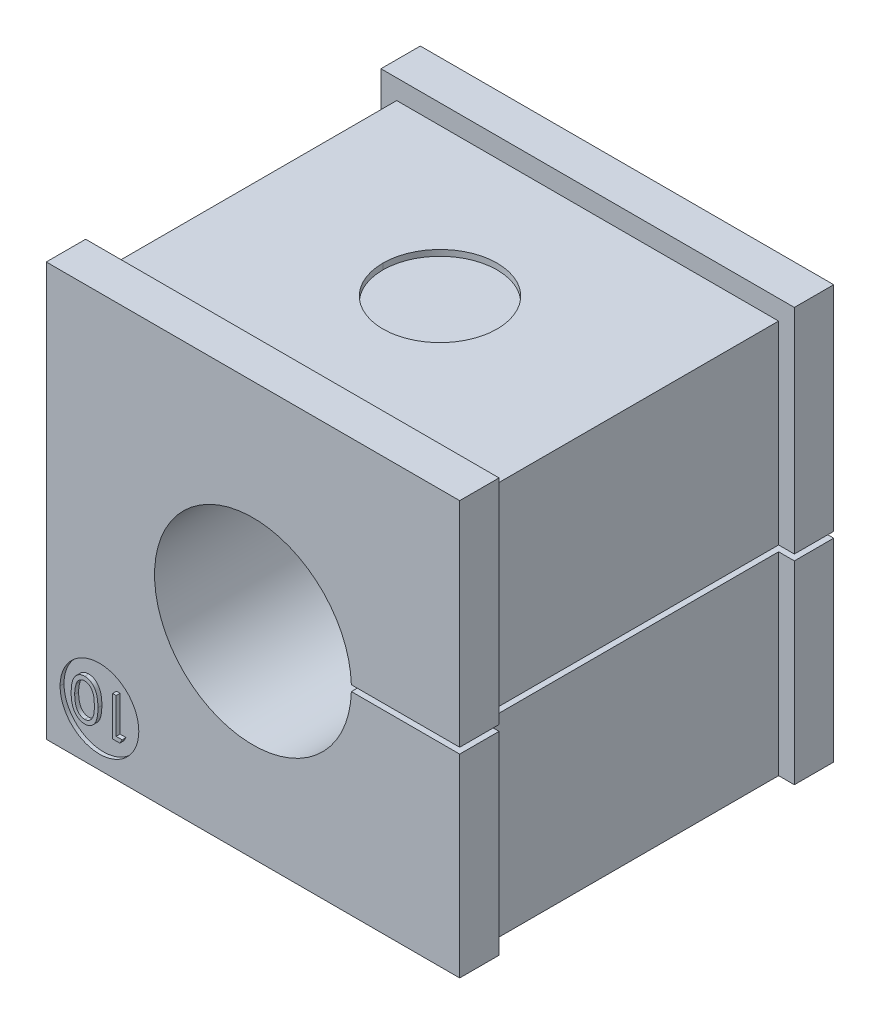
ISO-10303-21;
HEADER;
FILE_DESCRIPTION(('STEP AP214'),'2;1');
FILE_NAME('part.step','',(''),(''),'','','');
FILE_SCHEMA(('AUTOMOTIVE_DESIGN { 1 0 10303 214 1 1 1 1 }'));
ENDSEC;
DATA;
#1=APPLICATION_CONTEXT('core data for automotive mechanical design processes');
#2=APPLICATION_PROTOCOL_DEFINITION('international standard','automotive_design',2000,#1);
#3=PRODUCT_CONTEXT('',#1,'mechanical');
#4=PRODUCT('Part','Part','',(#3));
#5=PRODUCT_RELATED_PRODUCT_CATEGORY('part','',(#4));
#6=PRODUCT_DEFINITION_FORMATION('','',#4);
#7=PRODUCT_DEFINITION_CONTEXT('part definition',#1,'design');
#8=PRODUCT_DEFINITION('design','',#6,#7);
#9=PRODUCT_DEFINITION_SHAPE('','',#8);
#10=(LENGTH_UNIT() NAMED_UNIT(*) SI_UNIT(.MILLI.,.METRE.));
#11=(NAMED_UNIT(*) PLANE_ANGLE_UNIT() SI_UNIT($,.RADIAN.));
#12=(NAMED_UNIT(*) SI_UNIT($,.STERADIAN.) SOLID_ANGLE_UNIT());
#13=UNCERTAINTY_MEASURE_WITH_UNIT(LENGTH_MEASURE(1.E-05),#10,'distance_accuracy_value','');
#14=(GEOMETRIC_REPRESENTATION_CONTEXT(3) GLOBAL_UNCERTAINTY_ASSIGNED_CONTEXT((#13)) GLOBAL_UNIT_ASSIGNED_CONTEXT((#10,
#11,#12)) REPRESENTATION_CONTEXT('',''));
#15=CARTESIAN_POINT('',(0.,0.,0.));
#16=DIRECTION('',(0.,0.,1.));
#17=DIRECTION('',(1.,0.,0.));
#18=AXIS2_PLACEMENT_3D('',#15,#16,#17);
#19=CARTESIAN_POINT('',(2.7,-7.8,9.3));
#20=DIRECTION('',(0.,0.,1.));
#21=DIRECTION('',(1.,0.,0.));
#22=AXIS2_PLACEMENT_3D('',#19,#20,#21);
#23=PLANE('',#22);
#24=CARTESIAN_POINT('',(1.94839743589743,-8.64615384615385,9.3));
#25=CARTESIAN_POINT('',(1.97052206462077,-8.64500298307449,9.3));
#26=CARTESIAN_POINT('',(2.01481162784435,-8.64269916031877,9.3));
#27=CARTESIAN_POINT('',(2.08009276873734,-8.62616542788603,9.3));
#28=CARTESIAN_POINT('',(2.14288963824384,-8.59826438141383,9.3));
#29=CARTESIAN_POINT('',(2.19260675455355,-8.56670237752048,9.3));
#30=CARTESIAN_POINT('',(2.23043468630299,-8.53637890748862,9.3));
#31=CARTESIAN_POINT('',(2.25735371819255,-8.51049846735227,9.3));
#32=CARTESIAN_POINT('',(2.28275825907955,-8.48232609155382,9.3));
#33=CARTESIAN_POINT('',(2.30646398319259,-8.45146053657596,9.3));
#34=CARTESIAN_POINT('',(2.32788803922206,-8.41780363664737,9.3));
#35=CARTESIAN_POINT('',(2.34772640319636,-8.38181849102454,9.3));
#36=CARTESIAN_POINT('',(2.36567643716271,-8.34323203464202,9.3));
#37=CARTESIAN_POINT('',(2.38233810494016,-8.30174513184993,9.3));
#38=CARTESIAN_POINT('',(2.39675632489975,-8.25619161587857,9.3));
#39=CARTESIAN_POINT('',(2.40971998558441,-8.20610889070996,9.3));
#40=CARTESIAN_POINT('',(2.41972598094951,-8.15060616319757,9.3));
#41=CARTESIAN_POINT('',(2.42861042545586,-8.09023045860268,9.3));
#42=CARTESIAN_POINT('',(2.43532605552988,-8.02486011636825,9.3));
#43=CARTESIAN_POINT('',(2.43991706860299,-7.95443005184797,9.3));
#44=CARTESIAN_POINT('',(2.44339504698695,-7.87896055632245,9.3));
#45=CARTESIAN_POINT('',(2.44352354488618,-7.82684734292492,9.3));
#46=CARTESIAN_POINT('',(2.44358974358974,-7.8,9.3));
#47=(BOUNDED_CURVE() B_SPLINE_CURVE(3,(#24,#25,#26,#27,#28,#29,#30,#31,#32,#33,#34,#35,#36,#37,
#38,#39,#40,#41,#42,#43,#44,#45,#46),.UNSPECIFIED.,.F.,.F.) B_SPLINE_CURVE_WITH_KNOTS((4,1,1,1,
1,1,1,1,1,1,1,1,1,1,1,1,1,1,1,1,4),(0.,0.0603889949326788,0.120888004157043,0.182614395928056,
0.247364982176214,0.28108194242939,0.314871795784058,0.349216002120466,0.384592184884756,
0.421009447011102,0.458060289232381,0.496725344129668,0.537154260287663,0.580056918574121,
0.627112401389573,0.678324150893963,0.733972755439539,0.793738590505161,0.857708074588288,
0.926694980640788,1.),
.UNSPECIFIED.) CURVE() GEOMETRIC_REPRESENTATION_ITEM() RATIONAL_B_SPLINE_CURVE((1.,1.,1.,1.,1.,
1.,1.,1.,1.,1.,1.,1.,1.,1.,1.,1.,1.,1.,1.,1.,1.,1.,1.)) REPRESENTATION_ITEM(''));
#48=CARTESIAN_POINT('',(1.94839743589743,-8.64615384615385,9.3));
#49=VERTEX_POINT('',#48);
#50=CARTESIAN_POINT('',(2.44358974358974,-7.8,9.3));
#51=VERTEX_POINT('',#50);
#52=EDGE_CURVE('E395',#49,#51,#47,.T.);
#53=ORIENTED_EDGE('',*,*,#52,.T.);
#54=CARTESIAN_POINT('',(2.44358974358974,-7.8,9.3));
#55=CARTESIAN_POINT('',(2.44351999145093,-7.77328656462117,9.3));
#56=CARTESIAN_POINT('',(2.44338461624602,-7.72144103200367,9.3));
#57=CARTESIAN_POINT('',(2.43995038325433,-7.64623370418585,9.3));
#58=CARTESIAN_POINT('',(2.43517028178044,-7.57596997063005,9.3));
#59=CARTESIAN_POINT('',(2.42915663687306,-7.51067725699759,9.3));
#60=CARTESIAN_POINT('',(2.42015035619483,-7.45058375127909,9.3));
#61=CARTESIAN_POINT('',(2.40993215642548,-7.39543964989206,9.3));
#62=CARTESIAN_POINT('',(2.39767612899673,-7.34534693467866,9.3));
#63=CARTESIAN_POINT('',(2.38310328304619,-7.29986814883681,9.3));
#64=CARTESIAN_POINT('',(2.36650426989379,-7.25835830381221,9.3));
#65=CARTESIAN_POINT('',(2.34840987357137,-7.21971444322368,9.3));
#66=CARTESIAN_POINT('',(2.32880973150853,-7.18346652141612,9.3));
#67=CARTESIAN_POINT('',(2.30725415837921,-7.14974532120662,9.3));
#68=CARTESIAN_POINT('',(2.2834343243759,-7.11873918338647,9.3));
#69=CARTESIAN_POINT('',(2.25788189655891,-7.0903008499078,9.3));
#70=CARTESIAN_POINT('',(2.23044829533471,-7.06454611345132,9.3));
#71=CARTESIAN_POINT('',(2.19248024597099,-7.03398045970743,9.3));
#72=CARTESIAN_POINT('',(2.14259918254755,-7.00202296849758,9.3));
#73=CARTESIAN_POINT('',(2.07942980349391,-6.97453648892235,9.3));
#74=CARTESIAN_POINT('',(2.01449180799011,-6.95715133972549,9.3));
#75=CARTESIAN_POINT('',(1.97040335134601,-6.95494660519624,9.3));
#76=CARTESIAN_POINT('',(1.94839743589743,-6.95384615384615,9.3));
#77=(BOUNDED_CURVE() B_SPLINE_CURVE(3,(#54,#55,#56,#57,#58,#59,#60,#61,#62,#63,#64,#65,#66,#67,
#68,#69,#70,#71,#72,#73,#74,#75,#76),.UNSPECIFIED.,.F.,.F.) B_SPLINE_CURVE_WITH_KNOTS((4,1,1,1,
1,1,1,1,1,1,1,1,1,1,1,1,1,1,1,1,4),(0.,0.0729596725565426,0.141600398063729,0.205586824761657,
0.265331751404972,0.320634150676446,0.37150103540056,0.418479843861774,0.461393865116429,
0.501833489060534,0.54050878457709,0.577889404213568,0.614316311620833,0.649701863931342,
0.684570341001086,0.718633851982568,0.752359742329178,0.817630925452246,0.879707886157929,
0.93995847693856,1.),
.UNSPECIFIED.) CURVE() GEOMETRIC_REPRESENTATION_ITEM() RATIONAL_B_SPLINE_CURVE((1.,1.,1.,1.,1.,
1.,1.,1.,1.,1.,1.,1.,1.,1.,1.,1.,1.,1.,1.,1.,1.,1.,1.)) REPRESENTATION_ITEM(''));
#78=CARTESIAN_POINT('',(1.94839743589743,-6.95384615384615,9.3));
#79=VERTEX_POINT('',#78);
#80=EDGE_CURVE('E411',#51,#79,#77,.T.);
#81=ORIENTED_EDGE('',*,*,#80,.T.);
#82=CARTESIAN_POINT('',(1.94839743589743,-6.95384615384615,9.3));
#83=CARTESIAN_POINT('',(1.9262651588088,-6.95481109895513,9.3));
#84=CARTESIAN_POINT('',(1.88207911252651,-6.9567375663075,9.3));
#85=CARTESIAN_POINT('',(1.81718531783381,-6.97355101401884,9.3));
#86=CARTESIAN_POINT('',(1.75470732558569,-7.0008843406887,9.3));
#87=CARTESIAN_POINT('',(1.70540035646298,-7.03211201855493,9.3));
#88=CARTESIAN_POINT('',(1.66799258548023,-7.06204155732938,9.3));
#89=CARTESIAN_POINT('',(1.64118064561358,-7.08752994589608,9.3));
#90=CARTESIAN_POINT('',(1.61657438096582,-7.11607773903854,9.3));
#91=CARTESIAN_POINT('',(1.59323588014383,-7.14687689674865,9.3));
#92=CARTESIAN_POINT('',(1.57183074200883,-7.18051843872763,9.3));
#93=CARTESIAN_POINT('',(1.55236607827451,-7.21683987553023,9.3));
#94=CARTESIAN_POINT('',(1.53460416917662,-7.25594227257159,9.3));
#95=CARTESIAN_POINT('',(1.52448471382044,-7.28323926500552,9.3));
#96=CARTESIAN_POINT('',(1.5193108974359,-7.29719551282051,9.3));
#97=(BOUNDED_CURVE() B_SPLINE_CURVE(3,(#82,#83,#84,#85,#86,#87,#88,#89,#90,#91,#92,#93,#94,#95,
#96),.UNSPECIFIED.,.F.,.F.) B_SPLINE_CURVE_WITH_KNOTS((4,1,1,1,1,1,1,1,1,1,1,1,4),(0.,
0.112801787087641,0.225203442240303,0.339662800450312,0.459731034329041,0.521784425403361,
0.583968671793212,0.648210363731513,0.713910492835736,0.781026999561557,0.851466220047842,
0.92405851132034,1.),
.UNSPECIFIED.) CURVE() GEOMETRIC_REPRESENTATION_ITEM() RATIONAL_B_SPLINE_CURVE((1.,1.,1.,1.,1.,
1.,1.,1.,1.,1.,1.,1.,1.,1.,1.)) REPRESENTATION_ITEM(''));
#98=CARTESIAN_POINT('',(1.5193108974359,-7.29719551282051,9.3));
#99=VERTEX_POINT('',#98);
#100=EDGE_CURVE('E355',#79,#99,#97,.T.);
#101=ORIENTED_EDGE('',*,*,#100,.T.);
#102=CARTESIAN_POINT('',(1.5193108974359,-7.29719551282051,9.3));
#103=CARTESIAN_POINT('',(1.51328131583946,-7.31504107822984,9.3));
#104=CARTESIAN_POINT('',(1.50103867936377,-7.35127522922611,9.3));
#105=CARTESIAN_POINT('',(1.48526052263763,-7.40748303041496,9.3));
#106=CARTESIAN_POINT('',(1.47283458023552,-7.46645603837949,9.3));
#107=CARTESIAN_POINT('',(1.46165551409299,-7.52784181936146,9.3));
#108=CARTESIAN_POINT('',(1.45402519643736,-7.59209307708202,9.3));
#109=CARTESIAN_POINT('',(1.44788358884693,-7.65901101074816,9.3));
#110=CARTESIAN_POINT('',(1.44426605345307,-7.7286460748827,9.3));
#111=CARTESIAN_POINT('',(1.44381762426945,-7.77595749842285,9.3));
#112=CARTESIAN_POINT('',(1.44358974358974,-7.8,9.3));
#113=(BOUNDED_CURVE() B_SPLINE_CURVE(3,(#102,#103,#104,#105,#106,#107,#108,#109,#110,#111,#112),
.UNSPECIFIED.,.F.,.F.) B_SPLINE_CURVE_WITH_KNOTS((4,1,1,1,1,1,1,1,4),(0.,0.110588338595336,
0.224541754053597,0.342503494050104,0.464324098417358,0.590756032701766,0.722227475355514,
0.858842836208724,1.),
.UNSPECIFIED.) CURVE() GEOMETRIC_REPRESENTATION_ITEM() RATIONAL_B_SPLINE_CURVE((1.,1.,1.,1.,1.,
1.,1.,1.,1.,1.,1.)) REPRESENTATION_ITEM(''));
#114=CARTESIAN_POINT('',(1.44358974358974,-7.8,9.3));
#115=VERTEX_POINT('',#114);
#116=EDGE_CURVE('E351',#99,#115,#113,.T.);
#117=ORIENTED_EDGE('',*,*,#116,.T.);
#118=CARTESIAN_POINT('',(1.44358974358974,-7.8,9.3));
#119=CARTESIAN_POINT('',(1.44384107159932,-7.82404198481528,9.3));
#120=CARTESIAN_POINT('',(1.44433278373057,-7.87107906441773,9.3));
#121=CARTESIAN_POINT('',(1.44756337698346,-7.93989435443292,9.3));
#122=CARTESIAN_POINT('',(1.45275467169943,-8.00536826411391,9.3));
#123=CARTESIAN_POINT('',(1.45978097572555,-8.06756018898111,9.3));
#124=CARTESIAN_POINT('',(1.46942660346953,-8.12635943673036,9.3));
#125=CARTESIAN_POINT('',(1.48101004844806,-8.18185014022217,9.3));
#126=CARTESIAN_POINT('',(1.49459028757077,-8.23401736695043,9.3));
#127=CARTESIAN_POINT('',(1.51016729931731,-8.28299555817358,9.3));
#128=CARTESIAN_POINT('',(1.52772212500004,-8.32860899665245,9.3));
#129=CARTESIAN_POINT('',(1.54711580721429,-8.37095587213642,9.3));
#130=CARTESIAN_POINT('',(1.56780850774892,-8.410264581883,9.3));
#131=CARTESIAN_POINT('',(1.59029857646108,-8.4464086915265,9.3));
#132=CARTESIAN_POINT('',(1.61426781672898,-8.47959910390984,9.3));
#133=CARTESIAN_POINT('',(1.6405768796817,-8.50907179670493,9.3));
#134=CARTESIAN_POINT('',(1.66755463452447,-8.53626053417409,9.3));
#135=CARTESIAN_POINT('',(1.70592271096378,-8.56674111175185,9.3));
#136=CARTESIAN_POINT('',(1.75574481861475,-8.59806493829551,9.3));
#137=CARTESIAN_POINT('',(1.81816799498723,-8.62610687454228,9.3));
#138=CARTESIAN_POINT('',(1.88277329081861,-8.64270284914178,9.3));
#139=CARTESIAN_POINT('',(1.92653849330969,-8.64500434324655,9.3));
#140=CARTESIAN_POINT('',(1.94839743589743,-8.64615384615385,9.3));
#141=(BOUNDED_CURVE() B_SPLINE_CURVE(3,(#118,#119,#120,#121,#122,#123,#124,#125,#126,#127,#128,
#129,#130,#131,#132,#133,#134,#135,#136,#137,#138,#139,#140),.UNSPECIFIED.,.F.,
.F.) B_SPLINE_CURVE_WITH_KNOTS((4,1,1,1,1,1,1,1,1,1,1,1,1,1,1,1,1,1,1,1,4),(0.,
0.0656764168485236,0.128493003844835,0.188147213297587,0.245074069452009,0.299412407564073,
0.350856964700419,0.399878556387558,0.446605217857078,0.491184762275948,0.533303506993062,
0.57377697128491,0.61244771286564,0.649515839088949,0.685448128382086,0.720274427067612,
0.754003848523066,0.819086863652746,0.880502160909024,0.940315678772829,1.),
.UNSPECIFIED.) CURVE() GEOMETRIC_REPRESENTATION_ITEM() RATIONAL_B_SPLINE_CURVE((1.,1.,1.,1.,1.,
1.,1.,1.,1.,1.,1.,1.,1.,1.,1.,1.,1.,1.,1.,1.,1.,1.,1.)) REPRESENTATION_ITEM(''));
#142=EDGE_CURVE('E9',#115,#49,#141,.T.);
#143=ORIENTED_EDGE('',*,*,#142,.T.);
#144=EDGE_LOOP('',(#53,#81,#101,#117,#143));
#145=FACE_BOUND('',#144,.T.);
#146=ADVANCED_FACE('F15',(#145),#23,.T.);
#147=CARTESIAN_POINT('',(1.44358974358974,-7.8,9.5));
#148=CARTESIAN_POINT('',(1.44358974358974,-7.8,9.3));
#149=CARTESIAN_POINT('',(1.44384107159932,-7.82404198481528,9.5));
#150=CARTESIAN_POINT('',(1.44384107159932,-7.82404198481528,9.3));
#151=CARTESIAN_POINT('',(1.44433278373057,-7.87107906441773,9.5));
#152=CARTESIAN_POINT('',(1.44433278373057,-7.87107906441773,9.3));
#153=CARTESIAN_POINT('',(1.44756337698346,-7.93989435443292,9.5));
#154=CARTESIAN_POINT('',(1.44756337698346,-7.93989435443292,9.3));
#155=CARTESIAN_POINT('',(1.45275467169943,-8.00536826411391,9.5));
#156=CARTESIAN_POINT('',(1.45275467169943,-8.00536826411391,9.3));
#157=CARTESIAN_POINT('',(1.45978097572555,-8.06756018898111,9.5));
#158=CARTESIAN_POINT('',(1.45978097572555,-8.06756018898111,9.3));
#159=CARTESIAN_POINT('',(1.46942660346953,-8.12635943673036,9.5));
#160=CARTESIAN_POINT('',(1.46942660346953,-8.12635943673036,9.3));
#161=CARTESIAN_POINT('',(1.48101004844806,-8.18185014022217,9.5));
#162=CARTESIAN_POINT('',(1.48101004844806,-8.18185014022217,9.3));
#163=CARTESIAN_POINT('',(1.49459028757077,-8.23401736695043,9.5));
#164=CARTESIAN_POINT('',(1.49459028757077,-8.23401736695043,9.3));
#165=CARTESIAN_POINT('',(1.51016729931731,-8.28299555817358,9.5));
#166=CARTESIAN_POINT('',(1.51016729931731,-8.28299555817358,9.3));
#167=CARTESIAN_POINT('',(1.52772212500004,-8.32860899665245,9.5));
#168=CARTESIAN_POINT('',(1.52772212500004,-8.32860899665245,9.3));
#169=CARTESIAN_POINT('',(1.54711580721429,-8.37095587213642,9.5));
#170=CARTESIAN_POINT('',(1.54711580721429,-8.37095587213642,9.3));
#171=CARTESIAN_POINT('',(1.56780850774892,-8.410264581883,9.5));
#172=CARTESIAN_POINT('',(1.56780850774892,-8.410264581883,9.3));
#173=CARTESIAN_POINT('',(1.59029857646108,-8.4464086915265,9.5));
#174=CARTESIAN_POINT('',(1.59029857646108,-8.4464086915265,9.3));
#175=CARTESIAN_POINT('',(1.61426781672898,-8.47959910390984,9.5));
#176=CARTESIAN_POINT('',(1.61426781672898,-8.47959910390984,9.3));
#177=CARTESIAN_POINT('',(1.6405768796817,-8.50907179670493,9.5));
#178=CARTESIAN_POINT('',(1.6405768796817,-8.50907179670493,9.3));
#179=CARTESIAN_POINT('',(1.66755463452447,-8.53626053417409,9.5));
#180=CARTESIAN_POINT('',(1.66755463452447,-8.53626053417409,9.3));
#181=CARTESIAN_POINT('',(1.70592271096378,-8.56674111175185,9.5));
#182=CARTESIAN_POINT('',(1.70592271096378,-8.56674111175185,9.3));
#183=CARTESIAN_POINT('',(1.75574481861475,-8.59806493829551,9.5));
#184=CARTESIAN_POINT('',(1.75574481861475,-8.59806493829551,9.3));
#185=CARTESIAN_POINT('',(1.81816799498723,-8.62610687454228,9.5));
#186=CARTESIAN_POINT('',(1.81816799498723,-8.62610687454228,9.3));
#187=CARTESIAN_POINT('',(1.88277329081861,-8.64270284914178,9.5));
#188=CARTESIAN_POINT('',(1.88277329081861,-8.64270284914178,9.3));
#189=CARTESIAN_POINT('',(1.92653849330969,-8.64500434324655,9.5));
#190=CARTESIAN_POINT('',(1.92653849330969,-8.64500434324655,9.3));
#191=CARTESIAN_POINT('',(1.94839743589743,-8.64615384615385,9.5));
#192=CARTESIAN_POINT('',(1.94839743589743,-8.64615384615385,9.3));
#193=(BOUNDED_SURFACE() B_SPLINE_SURFACE(3,1,((#147,#148),(#149,#150),(#151,#152),(#153,#154),
(#155,#156),(#157,#158),(#159,#160),(#161,#162),(#163,#164),(#165,#166),(#167,#168),(#169,#170),
(#171,#172),(#173,#174),(#175,#176),(#177,#178),(#179,#180),(#181,#182),(#183,#184),(#185,#186),
(#187,#188),(#189,#190),(#191,#192)),.UNSPECIFIED.,.F.,.F.,.F.) B_SPLINE_SURFACE_WITH_KNOTS((4,
1,1,1,1,1,1,1,1,1,1,1,1,1,1,1,1,1,1,1,4),(2,2),(0.,0.0656764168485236,0.128493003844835,
0.188147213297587,0.245074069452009,0.299412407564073,0.350856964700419,0.399878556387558,
0.446605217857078,0.491184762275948,0.533303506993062,0.57377697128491,0.61244771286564,
0.649515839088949,0.685448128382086,0.720274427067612,0.754003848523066,0.819086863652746,
0.880502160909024,0.940315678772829,1.),(0.,1.),
.UNSPECIFIED.) GEOMETRIC_REPRESENTATION_ITEM() RATIONAL_B_SPLINE_SURFACE(((1.,1.),(1.,1.),(1.,
1.),(1.,1.),(1.,1.),(1.,1.),(1.,1.),(1.,1.),(1.,1.),(1.,1.),(1.,1.),(1.,1.),(1.,1.),(1.,1.),(1.,
1.),(1.,1.),(1.,1.),(1.,1.),(1.,1.),(1.,1.),(1.,1.),(1.,1.),(1.,1.))) REPRESENTATION_ITEM('') SURFACE());
#194=DIRECTION('',(0.,0.,-1.));
#195=VECTOR('',#194,1.);
#196=CARTESIAN_POINT('',(1.44358974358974,-7.8,9.5));
#197=LINE('',#196,#195);
#198=CARTESIAN_POINT('',(1.44358974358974,-7.8,9.5));
#199=VERTEX_POINT('',#198);
#200=EDGE_CURVE('E25',#199,#115,#197,.T.);
#201=CARTESIAN_POINT('',(1.44358974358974,-7.8,9.5));
#202=CARTESIAN_POINT('',(1.44384107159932,-7.82404198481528,9.5));
#203=CARTESIAN_POINT('',(1.44433278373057,-7.87107906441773,9.5));
#204=CARTESIAN_POINT('',(1.44756337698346,-7.93989435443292,9.5));
#205=CARTESIAN_POINT('',(1.45275467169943,-8.00536826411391,9.5));
#206=CARTESIAN_POINT('',(1.45978097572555,-8.06756018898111,9.5));
#207=CARTESIAN_POINT('',(1.46942660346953,-8.12635943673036,9.5));
#208=CARTESIAN_POINT('',(1.48101004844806,-8.18185014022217,9.5));
#209=CARTESIAN_POINT('',(1.49459028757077,-8.23401736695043,9.5));
#210=CARTESIAN_POINT('',(1.51016729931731,-8.28299555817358,9.5));
#211=CARTESIAN_POINT('',(1.52772212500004,-8.32860899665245,9.5));
#212=CARTESIAN_POINT('',(1.54711580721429,-8.37095587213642,9.5));
#213=CARTESIAN_POINT('',(1.56780850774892,-8.410264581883,9.5));
#214=CARTESIAN_POINT('',(1.59029857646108,-8.4464086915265,9.5));
#215=CARTESIAN_POINT('',(1.61426781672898,-8.47959910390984,9.5));
#216=CARTESIAN_POINT('',(1.6405768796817,-8.50907179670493,9.5));
#217=CARTESIAN_POINT('',(1.66755463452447,-8.53626053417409,9.5));
#218=CARTESIAN_POINT('',(1.70592271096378,-8.56674111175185,9.5));
#219=CARTESIAN_POINT('',(1.75574481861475,-8.59806493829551,9.5));
#220=CARTESIAN_POINT('',(1.81816799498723,-8.62610687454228,9.5));
#221=CARTESIAN_POINT('',(1.88277329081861,-8.64270284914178,9.5));
#222=CARTESIAN_POINT('',(1.92653849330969,-8.64500434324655,9.5));
#223=CARTESIAN_POINT('',(1.94839743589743,-8.64615384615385,9.5));
#224=(BOUNDED_CURVE() B_SPLINE_CURVE(3,(#201,#202,#203,#204,#205,#206,#207,#208,#209,#210,#211,
#212,#213,#214,#215,#216,#217,#218,#219,#220,#221,#222,#223),.UNSPECIFIED.,.F.,
.F.) B_SPLINE_CURVE_WITH_KNOTS((4,1,1,1,1,1,1,1,1,1,1,1,1,1,1,1,1,1,1,1,4),(0.,
0.0656764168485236,0.128493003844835,0.188147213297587,0.245074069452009,0.299412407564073,
0.350856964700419,0.399878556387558,0.446605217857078,0.491184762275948,0.533303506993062,
0.57377697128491,0.61244771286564,0.649515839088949,0.685448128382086,0.720274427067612,
0.754003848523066,0.819086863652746,0.880502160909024,0.940315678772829,1.),
.UNSPECIFIED.) CURVE() GEOMETRIC_REPRESENTATION_ITEM() RATIONAL_B_SPLINE_CURVE((1.,1.,1.,1.,1.,
1.,1.,1.,1.,1.,1.,1.,1.,1.,1.,1.,1.,1.,1.,1.,1.,1.,1.)) REPRESENTATION_ITEM(''));
#225=CARTESIAN_POINT('',(1.94839743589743,-8.64615384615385,9.5));
#226=VERTEX_POINT('',#225);
#227=EDGE_CURVE('E371',#199,#226,#224,.T.);
#228=DIRECTION('',(0.,0.,-1.));
#229=VECTOR('',#228,1.);
#230=CARTESIAN_POINT('',(1.94839743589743,-8.64615384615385,9.5));
#231=LINE('',#230,#229);
#232=EDGE_CURVE('E401',#226,#49,#231,.T.);
#233=ORIENTED_EDGE('',*,*,#142,.F.);
#234=ORIENTED_EDGE('',*,*,#200,.F.);
#235=ORIENTED_EDGE('',*,*,#227,.T.);
#236=ORIENTED_EDGE('',*,*,#232,.T.);
#237=EDGE_LOOP('',(#233,#234,#235,#236));
#238=FACE_BOUND('',#237,.T.);
#239=ADVANCED_FACE('F858',(#238),#193,.T.);
#240=CARTESIAN_POINT('',(1.5193108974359,-7.29719551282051,9.5));
#241=CARTESIAN_POINT('',(1.5193108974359,-7.29719551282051,9.3));
#242=CARTESIAN_POINT('',(1.51328131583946,-7.31504107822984,9.5));
#243=CARTESIAN_POINT('',(1.51328131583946,-7.31504107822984,9.3));
#244=CARTESIAN_POINT('',(1.50103867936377,-7.35127522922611,9.5));
#245=CARTESIAN_POINT('',(1.50103867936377,-7.35127522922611,9.3));
#246=CARTESIAN_POINT('',(1.48526052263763,-7.40748303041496,9.5));
#247=CARTESIAN_POINT('',(1.48526052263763,-7.40748303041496,9.3));
#248=CARTESIAN_POINT('',(1.47283458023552,-7.46645603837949,9.5));
#249=CARTESIAN_POINT('',(1.47283458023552,-7.46645603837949,9.3));
#250=CARTESIAN_POINT('',(1.46165551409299,-7.52784181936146,9.5));
#251=CARTESIAN_POINT('',(1.46165551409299,-7.52784181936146,9.3));
#252=CARTESIAN_POINT('',(1.45402519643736,-7.59209307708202,9.5));
#253=CARTESIAN_POINT('',(1.45402519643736,-7.59209307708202,9.3));
#254=CARTESIAN_POINT('',(1.44788358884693,-7.65901101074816,9.5));
#255=CARTESIAN_POINT('',(1.44788358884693,-7.65901101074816,9.3));
#256=CARTESIAN_POINT('',(1.44426605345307,-7.7286460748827,9.5));
#257=CARTESIAN_POINT('',(1.44426605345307,-7.7286460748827,9.3));
#258=CARTESIAN_POINT('',(1.44381762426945,-7.77595749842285,9.5));
#259=CARTESIAN_POINT('',(1.44381762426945,-7.77595749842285,9.3));
#260=CARTESIAN_POINT('',(1.44358974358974,-7.8,9.5));
#261=CARTESIAN_POINT('',(1.44358974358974,-7.8,9.3));
#262=(BOUNDED_SURFACE() B_SPLINE_SURFACE(3,1,((#240,#241),(#242,#243),(#244,#245),(#246,#247),
(#248,#249),(#250,#251),(#252,#253),(#254,#255),(#256,#257),(#258,#259),(#260,#261)),
.UNSPECIFIED.,.F.,.F.,.F.) B_SPLINE_SURFACE_WITH_KNOTS((4,1,1,1,1,1,1,1,4),(2,2),(0.,
0.110588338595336,0.224541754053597,0.342503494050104,0.464324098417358,0.590756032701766,
0.722227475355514,0.858842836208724,1.),(0.,1.),
.UNSPECIFIED.) GEOMETRIC_REPRESENTATION_ITEM() RATIONAL_B_SPLINE_SURFACE(((1.,1.),(1.,1.),(1.,
1.),(1.,1.),(1.,1.),(1.,1.),(1.,1.),(1.,1.),(1.,1.),(1.,1.),(1.,1.))) REPRESENTATION_ITEM('') SURFACE());
#263=DIRECTION('',(0.,0.,-1.));
#264=VECTOR('',#263,1.);
#265=CARTESIAN_POINT('',(1.5193108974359,-7.29719551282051,9.5));
#266=LINE('',#265,#264);
#267=CARTESIAN_POINT('',(1.5193108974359,-7.29719551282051,9.5));
#268=VERTEX_POINT('',#267);
#269=EDGE_CURVE('E344',#268,#99,#266,.T.);
#270=CARTESIAN_POINT('',(1.5193108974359,-7.29719551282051,9.5));
#271=CARTESIAN_POINT('',(1.51328131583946,-7.31504107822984,9.5));
#272=CARTESIAN_POINT('',(1.50103867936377,-7.35127522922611,9.5));
#273=CARTESIAN_POINT('',(1.48526052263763,-7.40748303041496,9.5));
#274=CARTESIAN_POINT('',(1.47283458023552,-7.46645603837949,9.5));
#275=CARTESIAN_POINT('',(1.46165551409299,-7.52784181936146,9.5));
#276=CARTESIAN_POINT('',(1.45402519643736,-7.59209307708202,9.5));
#277=CARTESIAN_POINT('',(1.44788358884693,-7.65901101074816,9.5));
#278=CARTESIAN_POINT('',(1.44426605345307,-7.7286460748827,9.5));
#279=CARTESIAN_POINT('',(1.44381762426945,-7.77595749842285,9.5));
#280=CARTESIAN_POINT('',(1.44358974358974,-7.8,9.5));
#281=(BOUNDED_CURVE() B_SPLINE_CURVE(3,(#270,#271,#272,#273,#274,#275,#276,#277,#278,#279,#280),
.UNSPECIFIED.,.F.,.F.) B_SPLINE_CURVE_WITH_KNOTS((4,1,1,1,1,1,1,1,4),(0.,0.110588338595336,
0.224541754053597,0.342503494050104,0.464324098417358,0.590756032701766,0.722227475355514,
0.858842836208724,1.),
.UNSPECIFIED.) CURVE() GEOMETRIC_REPRESENTATION_ITEM() RATIONAL_B_SPLINE_CURVE((1.,1.,1.,1.,1.,
1.,1.,1.,1.,1.,1.)) REPRESENTATION_ITEM(''));
#282=EDGE_CURVE('E348',#268,#199,#281,.T.);
#283=ORIENTED_EDGE('',*,*,#116,.F.);
#284=ORIENTED_EDGE('',*,*,#269,.F.);
#285=ORIENTED_EDGE('',*,*,#282,.T.);
#286=ORIENTED_EDGE('',*,*,#200,.T.);
#287=EDGE_LOOP('',(#283,#284,#285,#286));
#288=FACE_BOUND('',#287,.T.);
#289=ADVANCED_FACE('F346',(#288),#262,.T.);
#290=CARTESIAN_POINT('',(1.94839743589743,-6.95384615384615,9.5));
#291=CARTESIAN_POINT('',(1.94839743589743,-6.95384615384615,9.3));
#292=CARTESIAN_POINT('',(1.9262651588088,-6.95481109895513,9.5));
#293=CARTESIAN_POINT('',(1.9262651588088,-6.95481109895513,9.3));
#294=CARTESIAN_POINT('',(1.88207911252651,-6.9567375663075,9.5));
#295=CARTESIAN_POINT('',(1.88207911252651,-6.9567375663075,9.3));
#296=CARTESIAN_POINT('',(1.81718531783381,-6.97355101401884,9.5));
#297=CARTESIAN_POINT('',(1.81718531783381,-6.97355101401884,9.3));
#298=CARTESIAN_POINT('',(1.75470732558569,-7.0008843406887,9.5));
#299=CARTESIAN_POINT('',(1.75470732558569,-7.0008843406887,9.3));
#300=CARTESIAN_POINT('',(1.70540035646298,-7.03211201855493,9.5));
#301=CARTESIAN_POINT('',(1.70540035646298,-7.03211201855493,9.3));
#302=CARTESIAN_POINT('',(1.66799258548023,-7.06204155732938,9.5));
#303=CARTESIAN_POINT('',(1.66799258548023,-7.06204155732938,9.3));
#304=CARTESIAN_POINT('',(1.64118064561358,-7.08752994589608,9.5));
#305=CARTESIAN_POINT('',(1.64118064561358,-7.08752994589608,9.3));
#306=CARTESIAN_POINT('',(1.61657438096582,-7.11607773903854,9.5));
#307=CARTESIAN_POINT('',(1.61657438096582,-7.11607773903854,9.3));
#308=CARTESIAN_POINT('',(1.59323588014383,-7.14687689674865,9.5));
#309=CARTESIAN_POINT('',(1.59323588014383,-7.14687689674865,9.3));
#310=CARTESIAN_POINT('',(1.57183074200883,-7.18051843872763,9.5));
#311=CARTESIAN_POINT('',(1.57183074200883,-7.18051843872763,9.3));
#312=CARTESIAN_POINT('',(1.55236607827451,-7.21683987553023,9.5));
#313=CARTESIAN_POINT('',(1.55236607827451,-7.21683987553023,9.3));
#314=CARTESIAN_POINT('',(1.53460416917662,-7.25594227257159,9.5));
#315=CARTESIAN_POINT('',(1.53460416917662,-7.25594227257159,9.3));
#316=CARTESIAN_POINT('',(1.52448471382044,-7.28323926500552,9.5));
#317=CARTESIAN_POINT('',(1.52448471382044,-7.28323926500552,9.3));
#318=CARTESIAN_POINT('',(1.5193108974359,-7.29719551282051,9.5));
#319=CARTESIAN_POINT('',(1.5193108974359,-7.29719551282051,9.3));
#320=(BOUNDED_SURFACE() B_SPLINE_SURFACE(3,1,((#290,#291),(#292,#293),(#294,#295),(#296,#297),
(#298,#299),(#300,#301),(#302,#303),(#304,#305),(#306,#307),(#308,#309),(#310,#311),(#312,#313),
(#314,#315),(#316,#317),(#318,#319)),.UNSPECIFIED.,.F.,.F.,.F.) B_SPLINE_SURFACE_WITH_KNOTS((4,
1,1,1,1,1,1,1,1,1,1,1,4),(2,2),(0.,0.112801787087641,0.225203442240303,0.339662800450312,
0.459731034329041,0.521784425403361,0.583968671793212,0.648210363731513,0.713910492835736,
0.781026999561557,0.851466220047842,0.92405851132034,1.),(0.,1.),
.UNSPECIFIED.) GEOMETRIC_REPRESENTATION_ITEM() RATIONAL_B_SPLINE_SURFACE(((1.,1.),(1.,1.),(1.,
1.),(1.,1.),(1.,1.),(1.,1.),(1.,1.),(1.,1.),(1.,1.),(1.,1.),(1.,1.),(1.,1.),(1.,1.),(1.,1.),(1.,1.))) REPRESENTATION_ITEM('') SURFACE());
#321=DIRECTION('',(0.,0.,-1.));
#322=VECTOR('',#321,1.);
#323=CARTESIAN_POINT('',(1.94839743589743,-6.95384615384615,9.5));
#324=LINE('',#323,#322);
#325=CARTESIAN_POINT('',(1.94839743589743,-6.95384615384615,9.5));
#326=VERTEX_POINT('',#325);
#327=EDGE_CURVE('E18',#326,#79,#324,.T.);
#328=CARTESIAN_POINT('',(1.94839743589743,-6.95384615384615,9.5));
#329=CARTESIAN_POINT('',(1.9262651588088,-6.95481109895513,9.5));
#330=CARTESIAN_POINT('',(1.88207911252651,-6.9567375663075,9.5));
#331=CARTESIAN_POINT('',(1.81718531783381,-6.97355101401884,9.5));
#332=CARTESIAN_POINT('',(1.75470732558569,-7.0008843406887,9.5));
#333=CARTESIAN_POINT('',(1.70540035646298,-7.03211201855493,9.5));
#334=CARTESIAN_POINT('',(1.66799258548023,-7.06204155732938,9.5));
#335=CARTESIAN_POINT('',(1.64118064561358,-7.08752994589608,9.5));
#336=CARTESIAN_POINT('',(1.61657438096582,-7.11607773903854,9.5));
#337=CARTESIAN_POINT('',(1.59323588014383,-7.14687689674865,9.5));
#338=CARTESIAN_POINT('',(1.57183074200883,-7.18051843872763,9.5));
#339=CARTESIAN_POINT('',(1.55236607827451,-7.21683987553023,9.5));
#340=CARTESIAN_POINT('',(1.53460416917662,-7.25594227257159,9.5));
#341=CARTESIAN_POINT('',(1.52448471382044,-7.28323926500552,9.5));
#342=CARTESIAN_POINT('',(1.5193108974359,-7.29719551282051,9.5));
#343=(BOUNDED_CURVE() B_SPLINE_CURVE(3,(#328,#329,#330,#331,#332,#333,#334,#335,#336,#337,#338,
#339,#340,#341,#342),.UNSPECIFIED.,.F.,.F.) B_SPLINE_CURVE_WITH_KNOTS((4,1,1,1,1,1,1,1,1,1,1,1,
4),(0.,0.112801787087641,0.225203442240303,0.339662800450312,0.459731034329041,
0.521784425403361,0.583968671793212,0.648210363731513,0.713910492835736,0.781026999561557,
0.851466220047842,0.92405851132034,1.),
.UNSPECIFIED.) CURVE() GEOMETRIC_REPRESENTATION_ITEM() RATIONAL_B_SPLINE_CURVE((1.,1.,1.,1.,1.,
1.,1.,1.,1.,1.,1.,1.,1.,1.,1.)) REPRESENTATION_ITEM(''));
#344=EDGE_CURVE('E358',#326,#268,#343,.T.);
#345=ORIENTED_EDGE('',*,*,#100,.F.);
#346=ORIENTED_EDGE('',*,*,#327,.F.);
#347=ORIENTED_EDGE('',*,*,#344,.T.);
#348=ORIENTED_EDGE('',*,*,#269,.T.);
#349=EDGE_LOOP('',(#345,#346,#347,#348));
#350=FACE_BOUND('',#349,.T.);
#351=ADVANCED_FACE('F359',(#350),#320,.T.);
#352=CARTESIAN_POINT('',(2.44358974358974,-7.8,9.5));
#353=CARTESIAN_POINT('',(2.44358974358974,-7.8,9.3));
#354=CARTESIAN_POINT('',(2.44351999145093,-7.77328656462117,9.5));
#355=CARTESIAN_POINT('',(2.44351999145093,-7.77328656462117,9.3));
#356=CARTESIAN_POINT('',(2.44338461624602,-7.72144103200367,9.5));
#357=CARTESIAN_POINT('',(2.44338461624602,-7.72144103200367,9.3));
#358=CARTESIAN_POINT('',(2.43995038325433,-7.64623370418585,9.5));
#359=CARTESIAN_POINT('',(2.43995038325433,-7.64623370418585,9.3));
#360=CARTESIAN_POINT('',(2.43517028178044,-7.57596997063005,9.5));
#361=CARTESIAN_POINT('',(2.43517028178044,-7.57596997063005,9.3));
#362=CARTESIAN_POINT('',(2.42915663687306,-7.51067725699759,9.5));
#363=CARTESIAN_POINT('',(2.42915663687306,-7.51067725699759,9.3));
#364=CARTESIAN_POINT('',(2.42015035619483,-7.45058375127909,9.5));
#365=CARTESIAN_POINT('',(2.42015035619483,-7.45058375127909,9.3));
#366=CARTESIAN_POINT('',(2.40993215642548,-7.39543964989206,9.5));
#367=CARTESIAN_POINT('',(2.40993215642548,-7.39543964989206,9.3));
#368=CARTESIAN_POINT('',(2.39767612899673,-7.34534693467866,9.5));
#369=CARTESIAN_POINT('',(2.39767612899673,-7.34534693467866,9.3));
#370=CARTESIAN_POINT('',(2.38310328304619,-7.29986814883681,9.5));
#371=CARTESIAN_POINT('',(2.38310328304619,-7.29986814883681,9.3));
#372=CARTESIAN_POINT('',(2.36650426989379,-7.25835830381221,9.5));
#373=CARTESIAN_POINT('',(2.36650426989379,-7.25835830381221,9.3));
#374=CARTESIAN_POINT('',(2.34840987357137,-7.21971444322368,9.5));
#375=CARTESIAN_POINT('',(2.34840987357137,-7.21971444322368,9.3));
#376=CARTESIAN_POINT('',(2.32880973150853,-7.18346652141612,9.5));
#377=CARTESIAN_POINT('',(2.32880973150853,-7.18346652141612,9.3));
#378=CARTESIAN_POINT('',(2.30725415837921,-7.14974532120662,9.5));
#379=CARTESIAN_POINT('',(2.30725415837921,-7.14974532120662,9.3));
#380=CARTESIAN_POINT('',(2.2834343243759,-7.11873918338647,9.5));
#381=CARTESIAN_POINT('',(2.2834343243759,-7.11873918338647,9.3));
#382=CARTESIAN_POINT('',(2.25788189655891,-7.0903008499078,9.5));
#383=CARTESIAN_POINT('',(2.25788189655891,-7.0903008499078,9.3));
#384=CARTESIAN_POINT('',(2.23044829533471,-7.06454611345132,9.5));
#385=CARTESIAN_POINT('',(2.23044829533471,-7.06454611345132,9.3));
#386=CARTESIAN_POINT('',(2.19248024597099,-7.03398045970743,9.5));
#387=CARTESIAN_POINT('',(2.19248024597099,-7.03398045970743,9.3));
#388=CARTESIAN_POINT('',(2.14259918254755,-7.00202296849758,9.5));
#389=CARTESIAN_POINT('',(2.14259918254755,-7.00202296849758,9.3));
#390=CARTESIAN_POINT('',(2.07942980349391,-6.97453648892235,9.5));
#391=CARTESIAN_POINT('',(2.07942980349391,-6.97453648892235,9.3));
#392=CARTESIAN_POINT('',(2.01449180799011,-6.95715133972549,9.5));
#393=CARTESIAN_POINT('',(2.01449180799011,-6.95715133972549,9.3));
#394=CARTESIAN_POINT('',(1.97040335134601,-6.95494660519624,9.5));
#395=CARTESIAN_POINT('',(1.97040335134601,-6.95494660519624,9.3));
#396=CARTESIAN_POINT('',(1.94839743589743,-6.95384615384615,9.5));
#397=CARTESIAN_POINT('',(1.94839743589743,-6.95384615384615,9.3));
#398=(BOUNDED_SURFACE() B_SPLINE_SURFACE(3,1,((#352,#353),(#354,#355),(#356,#357),(#358,#359),
(#360,#361),(#362,#363),(#364,#365),(#366,#367),(#368,#369),(#370,#371),(#372,#373),(#374,#375),
(#376,#377),(#378,#379),(#380,#381),(#382,#383),(#384,#385),(#386,#387),(#388,#389),(#390,#391),
(#392,#393),(#394,#395),(#396,#397)),.UNSPECIFIED.,.F.,.F.,.F.) B_SPLINE_SURFACE_WITH_KNOTS((4,
1,1,1,1,1,1,1,1,1,1,1,1,1,1,1,1,1,1,1,4),(2,2),(0.,0.0729596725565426,0.141600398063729,
0.205586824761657,0.265331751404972,0.320634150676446,0.37150103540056,0.418479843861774,
0.461393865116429,0.501833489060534,0.54050878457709,0.577889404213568,0.614316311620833,
0.649701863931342,0.684570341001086,0.718633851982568,0.752359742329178,0.817630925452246,
0.879707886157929,0.93995847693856,1.),(0.,1.),
.UNSPECIFIED.) GEOMETRIC_REPRESENTATION_ITEM() RATIONAL_B_SPLINE_SURFACE(((1.,1.),(1.,1.),(1.,
1.),(1.,1.),(1.,1.),(1.,1.),(1.,1.),(1.,1.),(1.,1.),(1.,1.),(1.,1.),(1.,1.),(1.,1.),(1.,1.),(1.,
1.),(1.,1.),(1.,1.),(1.,1.),(1.,1.),(1.,1.),(1.,1.),(1.,1.),(1.,1.))) REPRESENTATION_ITEM('') SURFACE());
#399=DIRECTION('',(0.,0.,-1.));
#400=VECTOR('',#399,1.);
#401=CARTESIAN_POINT('',(2.44358974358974,-7.8,9.5));
#402=LINE('',#401,#400);
#403=CARTESIAN_POINT('',(2.44358974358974,-7.8,9.5));
#404=VERTEX_POINT('',#403);
#405=EDGE_CURVE('E408',#404,#51,#402,.T.);
#406=CARTESIAN_POINT('',(2.44358974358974,-7.8,9.5));
#407=CARTESIAN_POINT('',(2.44351999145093,-7.77328656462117,9.5));
#408=CARTESIAN_POINT('',(2.44338461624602,-7.72144103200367,9.5));
#409=CARTESIAN_POINT('',(2.43995038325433,-7.64623370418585,9.5));
#410=CARTESIAN_POINT('',(2.43517028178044,-7.57596997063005,9.5));
#411=CARTESIAN_POINT('',(2.42915663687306,-7.51067725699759,9.5));
#412=CARTESIAN_POINT('',(2.42015035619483,-7.45058375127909,9.5));
#413=CARTESIAN_POINT('',(2.40993215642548,-7.39543964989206,9.5));
#414=CARTESIAN_POINT('',(2.39767612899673,-7.34534693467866,9.5));
#415=CARTESIAN_POINT('',(2.38310328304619,-7.29986814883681,9.5));
#416=CARTESIAN_POINT('',(2.36650426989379,-7.25835830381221,9.5));
#417=CARTESIAN_POINT('',(2.34840987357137,-7.21971444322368,9.5));
#418=CARTESIAN_POINT('',(2.32880973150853,-7.18346652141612,9.5));
#419=CARTESIAN_POINT('',(2.30725415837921,-7.14974532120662,9.5));
#420=CARTESIAN_POINT('',(2.2834343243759,-7.11873918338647,9.5));
#421=CARTESIAN_POINT('',(2.25788189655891,-7.0903008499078,9.5));
#422=CARTESIAN_POINT('',(2.23044829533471,-7.06454611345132,9.5));
#423=CARTESIAN_POINT('',(2.19248024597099,-7.03398045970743,9.5));
#424=CARTESIAN_POINT('',(2.14259918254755,-7.00202296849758,9.5));
#425=CARTESIAN_POINT('',(2.07942980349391,-6.97453648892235,9.5));
#426=CARTESIAN_POINT('',(2.01449180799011,-6.95715133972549,9.5));
#427=CARTESIAN_POINT('',(1.97040335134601,-6.95494660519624,9.5));
#428=CARTESIAN_POINT('',(1.94839743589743,-6.95384615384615,9.5));
#429=(BOUNDED_CURVE() B_SPLINE_CURVE(3,(#406,#407,#408,#409,#410,#411,#412,#413,#414,#415,#416,
#417,#418,#419,#420,#421,#422,#423,#424,#425,#426,#427,#428),.UNSPECIFIED.,.F.,
.F.) B_SPLINE_CURVE_WITH_KNOTS((4,1,1,1,1,1,1,1,1,1,1,1,1,1,1,1,1,1,1,1,4),(0.,
0.0729596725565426,0.141600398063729,0.205586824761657,0.265331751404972,0.320634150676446,
0.37150103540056,0.418479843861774,0.461393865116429,0.501833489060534,0.54050878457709,
0.577889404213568,0.614316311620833,0.649701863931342,0.684570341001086,0.718633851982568,
0.752359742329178,0.817630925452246,0.879707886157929,0.93995847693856,1.),
.UNSPECIFIED.) CURVE() GEOMETRIC_REPRESENTATION_ITEM() RATIONAL_B_SPLINE_CURVE((1.,1.,1.,1.,1.,
1.,1.,1.,1.,1.,1.,1.,1.,1.,1.,1.,1.,1.,1.,1.,1.,1.,1.)) REPRESENTATION_ITEM(''));
#430=EDGE_CURVE('E472',#404,#326,#429,.T.);
#431=ORIENTED_EDGE('',*,*,#80,.F.);
#432=ORIENTED_EDGE('',*,*,#405,.F.);
#433=ORIENTED_EDGE('',*,*,#430,.T.);
#434=ORIENTED_EDGE('',*,*,#327,.T.);
#435=EDGE_LOOP('',(#431,#432,#433,#434));
#436=FACE_BOUND('',#435,.T.);
#437=ADVANCED_FACE('F864',(#436),#398,.T.);
#438=CARTESIAN_POINT('',(1.94839743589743,-8.64615384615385,9.5));
#439=CARTESIAN_POINT('',(1.94839743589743,-8.64615384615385,9.3));
#440=CARTESIAN_POINT('',(1.97052206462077,-8.64500298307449,9.5));
#441=CARTESIAN_POINT('',(1.97052206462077,-8.64500298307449,9.3));
#442=CARTESIAN_POINT('',(2.01481162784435,-8.64269916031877,9.5));
#443=CARTESIAN_POINT('',(2.01481162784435,-8.64269916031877,9.3));
#444=CARTESIAN_POINT('',(2.08009276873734,-8.62616542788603,9.5));
#445=CARTESIAN_POINT('',(2.08009276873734,-8.62616542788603,9.3));
#446=CARTESIAN_POINT('',(2.14288963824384,-8.59826438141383,9.5));
#447=CARTESIAN_POINT('',(2.14288963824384,-8.59826438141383,9.3));
#448=CARTESIAN_POINT('',(2.19260675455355,-8.56670237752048,9.5));
#449=CARTESIAN_POINT('',(2.19260675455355,-8.56670237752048,9.3));
#450=CARTESIAN_POINT('',(2.23043468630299,-8.53637890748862,9.5));
#451=CARTESIAN_POINT('',(2.23043468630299,-8.53637890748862,9.3));
#452=CARTESIAN_POINT('',(2.25735371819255,-8.51049846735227,9.5));
#453=CARTESIAN_POINT('',(2.25735371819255,-8.51049846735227,9.3));
#454=CARTESIAN_POINT('',(2.28275825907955,-8.48232609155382,9.5));
#455=CARTESIAN_POINT('',(2.28275825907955,-8.48232609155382,9.3));
#456=CARTESIAN_POINT('',(2.30646398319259,-8.45146053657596,9.5));
#457=CARTESIAN_POINT('',(2.30646398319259,-8.45146053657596,9.3));
#458=CARTESIAN_POINT('',(2.32788803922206,-8.41780363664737,9.5));
#459=CARTESIAN_POINT('',(2.32788803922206,-8.41780363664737,9.3));
#460=CARTESIAN_POINT('',(2.34772640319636,-8.38181849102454,9.5));
#461=CARTESIAN_POINT('',(2.34772640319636,-8.38181849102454,9.3));
#462=CARTESIAN_POINT('',(2.36567643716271,-8.34323203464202,9.5));
#463=CARTESIAN_POINT('',(2.36567643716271,-8.34323203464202,9.3));
#464=CARTESIAN_POINT('',(2.38233810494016,-8.30174513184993,9.5));
#465=CARTESIAN_POINT('',(2.38233810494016,-8.30174513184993,9.3));
#466=CARTESIAN_POINT('',(2.39675632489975,-8.25619161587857,9.5));
#467=CARTESIAN_POINT('',(2.39675632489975,-8.25619161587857,9.3));
#468=CARTESIAN_POINT('',(2.40971998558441,-8.20610889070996,9.5));
#469=CARTESIAN_POINT('',(2.40971998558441,-8.20610889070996,9.3));
#470=CARTESIAN_POINT('',(2.41972598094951,-8.15060616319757,9.5));
#471=CARTESIAN_POINT('',(2.41972598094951,-8.15060616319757,9.3));
#472=CARTESIAN_POINT('',(2.42861042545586,-8.09023045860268,9.5));
#473=CARTESIAN_POINT('',(2.42861042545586,-8.09023045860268,9.3));
#474=CARTESIAN_POINT('',(2.43532605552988,-8.02486011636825,9.5));
#475=CARTESIAN_POINT('',(2.43532605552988,-8.02486011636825,9.3));
#476=CARTESIAN_POINT('',(2.43991706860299,-7.95443005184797,9.5));
#477=CARTESIAN_POINT('',(2.43991706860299,-7.95443005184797,9.3));
#478=CARTESIAN_POINT('',(2.44339504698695,-7.87896055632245,9.5));
#479=CARTESIAN_POINT('',(2.44339504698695,-7.87896055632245,9.3));
#480=CARTESIAN_POINT('',(2.44352354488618,-7.82684734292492,9.5));
#481=CARTESIAN_POINT('',(2.44352354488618,-7.82684734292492,9.3));
#482=CARTESIAN_POINT('',(2.44358974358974,-7.8,9.5));
#483=CARTESIAN_POINT('',(2.44358974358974,-7.8,9.3));
#484=(BOUNDED_SURFACE() B_SPLINE_SURFACE(3,1,((#438,#439),(#440,#441),(#442,#443),(#444,#445),
(#446,#447),(#448,#449),(#450,#451),(#452,#453),(#454,#455),(#456,#457),(#458,#459),(#460,#461),
(#462,#463),(#464,#465),(#466,#467),(#468,#469),(#470,#471),(#472,#473),(#474,#475),(#476,#477),
(#478,#479),(#480,#481),(#482,#483)),.UNSPECIFIED.,.F.,.F.,.F.) B_SPLINE_SURFACE_WITH_KNOTS((4,
1,1,1,1,1,1,1,1,1,1,1,1,1,1,1,1,1,1,1,4),(2,2),(0.,0.0603889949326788,0.120888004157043,
0.182614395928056,0.247364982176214,0.28108194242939,0.314871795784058,0.349216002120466,
0.384592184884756,0.421009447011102,0.458060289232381,0.496725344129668,0.537154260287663,
0.580056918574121,0.627112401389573,0.678324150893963,0.733972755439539,0.793738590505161,
0.857708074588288,0.926694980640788,1.),(0.,1.),
.UNSPECIFIED.) GEOMETRIC_REPRESENTATION_ITEM() RATIONAL_B_SPLINE_SURFACE(((1.,1.),(1.,1.),(1.,
1.),(1.,1.),(1.,1.),(1.,1.),(1.,1.),(1.,1.),(1.,1.),(1.,1.),(1.,1.),(1.,1.),(1.,1.),(1.,1.),(1.,
1.),(1.,1.),(1.,1.),(1.,1.),(1.,1.),(1.,1.),(1.,1.),(1.,1.),(1.,1.))) REPRESENTATION_ITEM('') SURFACE());
#485=CARTESIAN_POINT('',(1.94839743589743,-8.64615384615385,9.5));
#486=CARTESIAN_POINT('',(1.97052206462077,-8.64500298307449,9.5));
#487=CARTESIAN_POINT('',(2.01481162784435,-8.64269916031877,9.5));
#488=CARTESIAN_POINT('',(2.08009276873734,-8.62616542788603,9.5));
#489=CARTESIAN_POINT('',(2.14288963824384,-8.59826438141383,9.5));
#490=CARTESIAN_POINT('',(2.19260675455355,-8.56670237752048,9.5));
#491=CARTESIAN_POINT('',(2.23043468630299,-8.53637890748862,9.5));
#492=CARTESIAN_POINT('',(2.25735371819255,-8.51049846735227,9.5));
#493=CARTESIAN_POINT('',(2.28275825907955,-8.48232609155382,9.5));
#494=CARTESIAN_POINT('',(2.30646398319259,-8.45146053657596,9.5));
#495=CARTESIAN_POINT('',(2.32788803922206,-8.41780363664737,9.5));
#496=CARTESIAN_POINT('',(2.34772640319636,-8.38181849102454,9.5));
#497=CARTESIAN_POINT('',(2.36567643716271,-8.34323203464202,9.5));
#498=CARTESIAN_POINT('',(2.38233810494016,-8.30174513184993,9.5));
#499=CARTESIAN_POINT('',(2.39675632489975,-8.25619161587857,9.5));
#500=CARTESIAN_POINT('',(2.40971998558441,-8.20610889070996,9.5));
#501=CARTESIAN_POINT('',(2.41972598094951,-8.15060616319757,9.5));
#502=CARTESIAN_POINT('',(2.42861042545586,-8.09023045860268,9.5));
#503=CARTESIAN_POINT('',(2.43532605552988,-8.02486011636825,9.5));
#504=CARTESIAN_POINT('',(2.43991706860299,-7.95443005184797,9.5));
#505=CARTESIAN_POINT('',(2.44339504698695,-7.87896055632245,9.5));
#506=CARTESIAN_POINT('',(2.44352354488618,-7.82684734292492,9.5));
#507=CARTESIAN_POINT('',(2.44358974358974,-7.8,9.5));
#508=(BOUNDED_CURVE() B_SPLINE_CURVE(3,(#485,#486,#487,#488,#489,#490,#491,#492,#493,#494,#495,
#496,#497,#498,#499,#500,#501,#502,#503,#504,#505,#506,#507),.UNSPECIFIED.,.F.,
.F.) B_SPLINE_CURVE_WITH_KNOTS((4,1,1,1,1,1,1,1,1,1,1,1,1,1,1,1,1,1,1,1,4),(0.,
0.0603889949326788,0.120888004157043,0.182614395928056,0.247364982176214,0.28108194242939,
0.314871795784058,0.349216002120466,0.384592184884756,0.421009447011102,0.458060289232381,
0.496725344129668,0.537154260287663,0.580056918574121,0.627112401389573,0.678324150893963,
0.733972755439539,0.793738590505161,0.857708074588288,0.926694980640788,1.),
.UNSPECIFIED.) CURVE() GEOMETRIC_REPRESENTATION_ITEM() RATIONAL_B_SPLINE_CURVE((1.,1.,1.,1.,1.,
1.,1.,1.,1.,1.,1.,1.,1.,1.,1.,1.,1.,1.,1.,1.,1.,1.,1.)) REPRESENTATION_ITEM(''));
#509=EDGE_CURVE('E376',#226,#404,#508,.T.);
#510=ORIENTED_EDGE('',*,*,#52,.F.);
#511=ORIENTED_EDGE('',*,*,#232,.F.);
#512=ORIENTED_EDGE('',*,*,#509,.T.);
#513=ORIENTED_EDGE('',*,*,#405,.T.);
#514=EDGE_LOOP('',(#510,#511,#512,#513));
#515=FACE_BOUND('',#514,.T.);
#516=ADVANCED_FACE('F863',(#515),#484,.T.);
#517=CARTESIAN_POINT('',(2.62307692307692,-7.79919871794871,9.5));
#518=CARTESIAN_POINT('',(2.62307692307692,-7.79919871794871,9.3));
#519=CARTESIAN_POINT('',(2.62288948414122,-7.83125436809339,9.5));
#520=CARTESIAN_POINT('',(2.62288948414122,-7.83125436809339,9.3));
#521=CARTESIAN_POINT('',(2.62252538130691,-7.89352293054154,9.5));
#522=CARTESIAN_POINT('',(2.62252538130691,-7.89352293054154,9.3));
#523=CARTESIAN_POINT('',(2.61847485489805,-7.98425701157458,9.5));
#524=CARTESIAN_POINT('',(2.61847485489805,-7.98425701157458,9.3));
#525=CARTESIAN_POINT('',(2.61174608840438,-8.06937717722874,9.5));
#526=CARTESIAN_POINT('',(2.61174608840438,-8.06937717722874,9.3));
#527=CARTESIAN_POINT('',(2.60252473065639,-8.14888749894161,9.5));
#528=CARTESIAN_POINT('',(2.60252473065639,-8.14888749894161,9.3));
#529=CARTESIAN_POINT('',(2.5913030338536,-8.22280851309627,9.5));
#530=CARTESIAN_POINT('',(2.5913030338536,-8.22280851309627,9.3));
#531=CARTESIAN_POINT('',(2.57632273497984,-8.29094264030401,9.5));
#532=CARTESIAN_POINT('',(2.57632273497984,-8.29094264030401,9.3));
#533=CARTESIAN_POINT('',(2.55928691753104,-8.3536053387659,9.5));
#534=CARTESIAN_POINT('',(2.55928691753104,-8.3536053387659,9.3));
#535=CARTESIAN_POINT('',(2.53954242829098,-8.41100057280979,9.5));
#536=CARTESIAN_POINT('',(2.53954242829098,-8.41100057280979,9.3));
#537=CARTESIAN_POINT('',(2.51726449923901,-8.46390288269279,9.5));
#538=CARTESIAN_POINT('',(2.51726449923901,-8.46390288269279,9.3));
#539=CARTESIAN_POINT('',(2.49301350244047,-8.51328601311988,9.5));
#540=CARTESIAN_POINT('',(2.49301350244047,-8.51328601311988,9.3));
#541=CARTESIAN_POINT('',(2.46584371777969,-8.55909097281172,9.5));
#542=CARTESIAN_POINT('',(2.46584371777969,-8.55909097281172,9.3));
#543=CARTESIAN_POINT('',(2.43724938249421,-8.60199264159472,9.5));
#544=CARTESIAN_POINT('',(2.43724938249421,-8.60199264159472,9.3));
#545=CARTESIAN_POINT('',(2.40622974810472,-8.64155927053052,9.5));
#546=CARTESIAN_POINT('',(2.40622974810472,-8.64155927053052,9.3));
#547=CARTESIAN_POINT('',(2.37289268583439,-8.67761303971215,9.5));
#548=CARTESIAN_POINT('',(2.37289268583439,-8.67761303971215,9.3));
#549=CARTESIAN_POINT('',(2.33753183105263,-8.71071265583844,9.5));
#550=CARTESIAN_POINT('',(2.33753183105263,-8.71071265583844,9.3));
#551=CARTESIAN_POINT('',(2.2999798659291,-8.74031383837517,9.5));
#552=CARTESIAN_POINT('',(2.2999798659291,-8.74031383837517,9.3));
#553=CARTESIAN_POINT('',(2.2605947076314,-8.76610732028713,9.5));
#554=CARTESIAN_POINT('',(2.2605947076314,-8.76610732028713,9.3));
#555=CARTESIAN_POINT('',(2.22054142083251,-8.78948852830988,9.5));
#556=CARTESIAN_POINT('',(2.22054142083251,-8.78948852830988,9.3));
#557=CARTESIAN_POINT('',(2.17867760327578,-8.80798370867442,9.5));
#558=CARTESIAN_POINT('',(2.17867760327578,-8.80798370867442,9.3));
#559=CARTESIAN_POINT('',(2.13603584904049,-8.82379921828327,9.5));
#560=CARTESIAN_POINT('',(2.13603584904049,-8.82379921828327,9.3));
#561=CARTESIAN_POINT('',(2.0922726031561,-8.8363272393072,9.5));
#562=CARTESIAN_POINT('',(2.0922726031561,-8.8363272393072,9.3));
#563=CARTESIAN_POINT('',(2.04736880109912,-8.84504146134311,9.5));
#564=CARTESIAN_POINT('',(2.04736880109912,-8.84504146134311,9.3));
#565=CARTESIAN_POINT('',(2.00128414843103,-8.85049326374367,9.5));
#566=CARTESIAN_POINT('',(2.00128414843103,-8.85049326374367,9.3));
#567=CARTESIAN_POINT('',(1.9701810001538,-8.85101662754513,9.5));
#568=CARTESIAN_POINT('',(1.9701810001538,-8.85101662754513,9.3));
#569=CARTESIAN_POINT('',(1.95440705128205,-8.85128205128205,9.5));
#570=CARTESIAN_POINT('',(1.95440705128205,-8.85128205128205,9.3));
#571=(BOUNDED_SURFACE() B_SPLINE_SURFACE(3,1,((#517,#518),(#519,#520),(#521,#522),(#523,#524),
(#525,#526),(#527,#528),(#529,#530),(#531,#532),(#533,#534),(#535,#536),(#537,#538),(#539,#540),
(#541,#542),(#543,#544),(#545,#546),(#547,#548),(#549,#550),(#551,#552),(#553,#554),(#555,#556),
(#557,#558),(#559,#560),(#561,#562),(#563,#564),(#565,#566),(#567,#568),(#569,#570)),
.UNSPECIFIED.,.F.,.F.,.F.) B_SPLINE_SURFACE_WITH_KNOTS((4,1,1,1,1,1,1,1,1,1,1,1,1,1,1,1,1,1,1,1,
1,1,1,1,4),(2,2),(0.,0.0685938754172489,0.133244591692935,0.194310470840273,0.251276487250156,
0.304510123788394,0.354231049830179,0.400476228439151,0.443405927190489,0.48400959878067,
0.52324660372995,0.561036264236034,0.597893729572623,0.633511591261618,0.668500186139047,
0.702875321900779,0.737064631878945,0.770672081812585,0.803567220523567,0.83618309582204,
0.868461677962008,0.900847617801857,0.933467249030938,0.966257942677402,1.),(0.,1.),
.UNSPECIFIED.) GEOMETRIC_REPRESENTATION_ITEM() RATIONAL_B_SPLINE_SURFACE(((1.,1.),(1.,1.),(1.,
1.),(1.,1.),(1.,1.),(1.,1.),(1.,1.),(1.,1.),(1.,1.),(1.,1.),(1.,1.),(1.,1.),(1.,1.),(1.,1.),(1.,
1.),(1.,1.),(1.,1.),(1.,1.),(1.,1.),(1.,1.),(1.,1.),(1.,1.),(1.,1.),(1.,1.),(1.,1.),(1.,1.),(1.,1.))) REPRESENTATION_ITEM('') SURFACE());
#572=CARTESIAN_POINT('',(2.62307692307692,-7.79919871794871,9.3));
#573=CARTESIAN_POINT('',(2.62288948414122,-7.83125436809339,9.3));
#574=CARTESIAN_POINT('',(2.62252538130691,-7.89352293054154,9.3));
#575=CARTESIAN_POINT('',(2.61847485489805,-7.98425701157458,9.3));
#576=CARTESIAN_POINT('',(2.61174608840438,-8.06937717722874,9.3));
#577=CARTESIAN_POINT('',(2.60252473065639,-8.14888749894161,9.3));
#578=CARTESIAN_POINT('',(2.5913030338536,-8.22280851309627,9.3));
#579=CARTESIAN_POINT('',(2.57632273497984,-8.29094264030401,9.3));
#580=CARTESIAN_POINT('',(2.55928691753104,-8.3536053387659,9.3));
#581=CARTESIAN_POINT('',(2.53954242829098,-8.41100057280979,9.3));
#582=CARTESIAN_POINT('',(2.51726449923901,-8.46390288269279,9.3));
#583=CARTESIAN_POINT('',(2.49301350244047,-8.51328601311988,9.3));
#584=CARTESIAN_POINT('',(2.46584371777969,-8.55909097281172,9.3));
#585=CARTESIAN_POINT('',(2.43724938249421,-8.60199264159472,9.3));
#586=CARTESIAN_POINT('',(2.40622974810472,-8.64155927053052,9.3));
#587=CARTESIAN_POINT('',(2.37289268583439,-8.67761303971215,9.3));
#588=CARTESIAN_POINT('',(2.33753183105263,-8.71071265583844,9.3));
#589=CARTESIAN_POINT('',(2.2999798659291,-8.74031383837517,9.3));
#590=CARTESIAN_POINT('',(2.2605947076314,-8.76610732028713,9.3));
#591=CARTESIAN_POINT('',(2.22054142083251,-8.78948852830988,9.3));
#592=CARTESIAN_POINT('',(2.17867760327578,-8.80798370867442,9.3));
#593=CARTESIAN_POINT('',(2.13603584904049,-8.82379921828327,9.3));
#594=CARTESIAN_POINT('',(2.0922726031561,-8.8363272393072,9.3));
#595=CARTESIAN_POINT('',(2.04736880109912,-8.84504146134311,9.3));
#596=CARTESIAN_POINT('',(2.00128414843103,-8.85049326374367,9.3));
#597=CARTESIAN_POINT('',(1.9701810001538,-8.85101662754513,9.3));
#598=CARTESIAN_POINT('',(1.95440705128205,-8.85128205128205,9.3));
#599=(BOUNDED_CURVE() B_SPLINE_CURVE(3,(#572,#573,#574,#575,#576,#577,#578,#579,#580,#581,#582,
#583,#584,#585,#586,#587,#588,#589,#590,#591,#592,#593,#594,#595,#596,#597,#598),.UNSPECIFIED.,
.F.,.F.) B_SPLINE_CURVE_WITH_KNOTS((4,1,1,1,1,1,1,1,1,1,1,1,1,1,1,1,1,1,1,1,1,1,1,1,4),(0.,
0.0685938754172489,0.133244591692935,0.194310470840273,0.251276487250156,0.304510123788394,
0.354231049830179,0.400476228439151,0.443405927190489,0.48400959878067,0.52324660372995,
0.561036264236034,0.597893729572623,0.633511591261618,0.668500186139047,0.702875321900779,
0.737064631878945,0.770672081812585,0.803567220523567,0.83618309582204,0.868461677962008,
0.900847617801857,0.933467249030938,0.966257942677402,1.),
.UNSPECIFIED.) CURVE() GEOMETRIC_REPRESENTATION_ITEM() RATIONAL_B_SPLINE_CURVE((1.,1.,1.,1.,1.,
1.,1.,1.,1.,1.,1.,1.,1.,1.,1.,1.,1.,1.,1.,1.,1.,1.,1.,1.,1.,1.,1.)) REPRESENTATION_ITEM(''));
#600=CARTESIAN_POINT('',(2.62307692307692,-7.79919871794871,9.3));
#601=VERTEX_POINT('',#600);
#602=CARTESIAN_POINT('',(1.95440705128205,-8.85128205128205,9.3));
#603=VERTEX_POINT('',#602);
#604=EDGE_CURVE('E491',#601,#603,#599,.T.);
#605=DIRECTION('',(0.,0.,-1.));
#606=VECTOR('',#605,1.);
#607=CARTESIAN_POINT('',(2.62307692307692,-7.79919871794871,9.5));
#608=LINE('',#607,#606);
#609=CARTESIAN_POINT('',(2.62307692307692,-7.79919871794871,9.5));
#610=VERTEX_POINT('',#609);
#611=EDGE_CURVE('E394',#610,#601,#608,.T.);
#612=CARTESIAN_POINT('',(2.62307692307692,-7.79919871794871,9.5));
#613=CARTESIAN_POINT('',(2.62288948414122,-7.83125436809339,9.5));
#614=CARTESIAN_POINT('',(2.62252538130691,-7.89352293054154,9.5));
#615=CARTESIAN_POINT('',(2.61847485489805,-7.98425701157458,9.5));
#616=CARTESIAN_POINT('',(2.61174608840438,-8.06937717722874,9.5));
#617=CARTESIAN_POINT('',(2.60252473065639,-8.14888749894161,9.5));
#618=CARTESIAN_POINT('',(2.5913030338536,-8.22280851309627,9.5));
#619=CARTESIAN_POINT('',(2.57632273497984,-8.29094264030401,9.5));
#620=CARTESIAN_POINT('',(2.55928691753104,-8.3536053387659,9.5));
#621=CARTESIAN_POINT('',(2.53954242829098,-8.41100057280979,9.5));
#622=CARTESIAN_POINT('',(2.51726449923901,-8.46390288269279,9.5));
#623=CARTESIAN_POINT('',(2.49301350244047,-8.51328601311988,9.5));
#624=CARTESIAN_POINT('',(2.46584371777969,-8.55909097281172,9.5));
#625=CARTESIAN_POINT('',(2.43724938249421,-8.60199264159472,9.5));
#626=CARTESIAN_POINT('',(2.40622974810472,-8.64155927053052,9.5));
#627=CARTESIAN_POINT('',(2.37289268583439,-8.67761303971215,9.5));
#628=CARTESIAN_POINT('',(2.33753183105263,-8.71071265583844,9.5));
#629=CARTESIAN_POINT('',(2.2999798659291,-8.74031383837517,9.5));
#630=CARTESIAN_POINT('',(2.2605947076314,-8.76610732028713,9.5));
#631=CARTESIAN_POINT('',(2.22054142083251,-8.78948852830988,9.5));
#632=CARTESIAN_POINT('',(2.17867760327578,-8.80798370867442,9.5));
#633=CARTESIAN_POINT('',(2.13603584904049,-8.82379921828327,9.5));
#634=CARTESIAN_POINT('',(2.0922726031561,-8.8363272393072,9.5));
#635=CARTESIAN_POINT('',(2.04736880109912,-8.84504146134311,9.5));
#636=CARTESIAN_POINT('',(2.00128414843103,-8.85049326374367,9.5));
#637=CARTESIAN_POINT('',(1.9701810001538,-8.85101662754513,9.5));
#638=CARTESIAN_POINT('',(1.95440705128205,-8.85128205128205,9.5));
#639=(BOUNDED_CURVE() B_SPLINE_CURVE(3,(#612,#613,#614,#615,#616,#617,#618,#619,#620,#621,#622,
#623,#624,#625,#626,#627,#628,#629,#630,#631,#632,#633,#634,#635,#636,#637,#638),.UNSPECIFIED.,
.F.,.F.) B_SPLINE_CURVE_WITH_KNOTS((4,1,1,1,1,1,1,1,1,1,1,1,1,1,1,1,1,1,1,1,1,1,1,1,4),(0.,
0.0685938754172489,0.133244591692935,0.194310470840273,0.251276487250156,0.304510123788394,
0.354231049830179,0.400476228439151,0.443405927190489,0.48400959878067,0.52324660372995,
0.561036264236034,0.597893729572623,0.633511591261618,0.668500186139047,0.702875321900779,
0.737064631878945,0.770672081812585,0.803567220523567,0.83618309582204,0.868461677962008,
0.900847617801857,0.933467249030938,0.966257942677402,1.),
.UNSPECIFIED.) CURVE() GEOMETRIC_REPRESENTATION_ITEM() RATIONAL_B_SPLINE_CURVE((1.,1.,1.,1.,1.,
1.,1.,1.,1.,1.,1.,1.,1.,1.,1.,1.,1.,1.,1.,1.,1.,1.,1.,1.,1.,1.,1.)) REPRESENTATION_ITEM(''));
#640=CARTESIAN_POINT('',(1.95440705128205,-8.85128205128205,9.5));
#641=VERTEX_POINT('',#640);
#642=EDGE_CURVE('E479',#610,#641,#639,.T.);
#643=DIRECTION('',(0.,0.,-1.));
#644=VECTOR('',#643,1.);
#645=CARTESIAN_POINT('',(1.95440705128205,-8.85128205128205,9.5));
#646=LINE('',#645,#644);
#647=EDGE_CURVE('E402',#641,#603,#646,.T.);
#648=ORIENTED_EDGE('',*,*,#604,.F.);
#649=ORIENTED_EDGE('',*,*,#611,.F.);
#650=ORIENTED_EDGE('',*,*,#642,.T.);
#651=ORIENTED_EDGE('',*,*,#647,.T.);
#652=EDGE_LOOP('',(#648,#649,#650,#651));
#653=FACE_BOUND('',#652,.T.);
#654=ADVANCED_FACE('F833',(#653),#571,.T.);
#655=CARTESIAN_POINT('',(1.95440705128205,-8.85128205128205,9.5));
#656=CARTESIAN_POINT('',(1.95440705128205,-8.85128205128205,9.3));
#657=CARTESIAN_POINT('',(1.9384933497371,-8.8510613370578,9.5));
#658=CARTESIAN_POINT('',(1.9384933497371,-8.8510613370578,9.3));
#659=CARTESIAN_POINT('',(1.90683068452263,-8.85062219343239,9.5));
#660=CARTESIAN_POINT('',(1.90683068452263,-8.85062219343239,9.3));
#661=CARTESIAN_POINT('',(1.86018774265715,-8.84444098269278,9.5));
#662=CARTESIAN_POINT('',(1.86018774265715,-8.84444098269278,9.3));
#663=CARTESIAN_POINT('',(1.8143572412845,-8.83646271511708,9.5));
#664=CARTESIAN_POINT('',(1.8143572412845,-8.83646271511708,9.3));
#665=CARTESIAN_POINT('',(1.77003451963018,-8.82366688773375,9.5));
#666=CARTESIAN_POINT('',(1.77003451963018,-8.82366688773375,9.3));
#667=CARTESIAN_POINT('',(1.72638152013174,-8.80835502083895,9.5));
#668=CARTESIAN_POINT('',(1.72638152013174,-8.80835502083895,9.3));
#669=CARTESIAN_POINT('',(1.68448380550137,-8.78815125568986,9.5));
#670=CARTESIAN_POINT('',(1.68448380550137,-8.78815125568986,9.3));
#671=CARTESIAN_POINT('',(1.64286216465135,-8.76617809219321,9.5));
#672=CARTESIAN_POINT('',(1.64286216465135,-8.76617809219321,9.3));
#673=CARTESIAN_POINT('',(1.60340741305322,-8.73937268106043,9.5));
#674=CARTESIAN_POINT('',(1.60340741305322,-8.73937268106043,9.3));
#675=CARTESIAN_POINT('',(1.56494071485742,-8.70974829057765,9.5));
#676=CARTESIAN_POINT('',(1.56494071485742,-8.70974829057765,9.3));
#677=CARTESIAN_POINT('',(1.52888220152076,-8.67611703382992,9.5));
#678=CARTESIAN_POINT('',(1.52888220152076,-8.67611703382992,9.3));
#679=CARTESIAN_POINT('',(1.49431012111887,-8.63940965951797,9.5));
#680=CARTESIAN_POINT('',(1.49431012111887,-8.63940965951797,9.3));
#681=CARTESIAN_POINT('',(1.46253024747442,-8.59880748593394,9.5));
#682=CARTESIAN_POINT('',(1.46253024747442,-8.59880748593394,9.3));
#683=CARTESIAN_POINT('',(1.43218053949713,-8.55493306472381,9.5));
#684=CARTESIAN_POINT('',(1.43218053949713,-8.55493306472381,9.3));
#685=CARTESIAN_POINT('',(1.40441310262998,-8.5074186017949,9.5));
#686=CARTESIAN_POINT('',(1.40441310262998,-8.5074186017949,9.3));
#687=CARTESIAN_POINT('',(1.37865042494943,-8.45636939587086,9.5));
#688=CARTESIAN_POINT('',(1.37865042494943,-8.45636939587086,9.3));
#689=CARTESIAN_POINT('',(1.35440823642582,-8.40202210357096,9.5));
#690=CARTESIAN_POINT('',(1.35440823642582,-8.40202210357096,9.3));
#691=CARTESIAN_POINT('',(1.33320908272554,-8.34292502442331,9.5));
#692=CARTESIAN_POINT('',(1.33320908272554,-8.34292502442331,9.3));
#693=CARTESIAN_POINT('',(1.31436134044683,-8.27944676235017,9.5));
#694=CARTESIAN_POINT('',(1.31436134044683,-8.27944676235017,9.3));
#695=CARTESIAN_POINT('',(1.29891242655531,-8.21101249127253,9.5));
#696=CARTESIAN_POINT('',(1.29891242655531,-8.21101249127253,9.3));
#697=CARTESIAN_POINT('',(1.28613644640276,-8.13800343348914,9.5));
#698=CARTESIAN_POINT('',(1.28613644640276,-8.13800343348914,9.3));
#699=CARTESIAN_POINT('',(1.27621985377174,-8.06005790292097,9.5));
#700=CARTESIAN_POINT('',(1.27621985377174,-8.06005790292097,9.3));
#701=CARTESIAN_POINT('',(1.26900272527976,-7.97733382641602,9.5));
#702=CARTESIAN_POINT('',(1.26900272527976,-7.97733382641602,9.3));
#703=CARTESIAN_POINT('',(1.26518910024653,-7.8897794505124,9.5));
#704=CARTESIAN_POINT('',(1.26518910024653,-7.8897794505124,9.3));
#705=CARTESIAN_POINT('',(1.2644710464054,-7.82991780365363,9.5));
#706=CARTESIAN_POINT('',(1.2644710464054,-7.82991780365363,9.3));
#707=CARTESIAN_POINT('',(1.26410256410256,-7.79919871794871,9.5));
#708=CARTESIAN_POINT('',(1.26410256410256,-7.79919871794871,9.3));
#709=(BOUNDED_SURFACE() B_SPLINE_SURFACE(3,1,((#655,#656),(#657,#658),(#659,#660),(#661,#662),
(#663,#664),(#665,#666),(#667,#668),(#669,#670),(#671,#672),(#673,#674),(#675,#676),(#677,#678),
(#679,#680),(#681,#682),(#683,#684),(#685,#686),(#687,#688),(#689,#690),(#691,#692),(#693,#694),
(#695,#696),(#697,#698),(#699,#700),(#701,#702),(#703,#704),(#705,#706),(#707,#708)),
.UNSPECIFIED.,.F.,.F.,.F.) B_SPLINE_SURFACE_WITH_KNOTS((4,1,1,1,1,1,1,1,1,1,1,1,1,1,1,1,1,1,1,1,
1,1,1,1,4),(2,2),(0.,0.0337879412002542,0.0672261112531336,0.0998413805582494,0.132545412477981,
0.165129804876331,0.198010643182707,0.231279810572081,0.265043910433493,0.299215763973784,
0.334358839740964,0.369695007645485,0.406257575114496,0.44380351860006,0.482981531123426,
0.523084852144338,0.56526677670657,0.609342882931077,0.656392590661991,0.70588701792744,
0.758325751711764,0.813832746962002,0.872795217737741,0.934722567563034,1.),(0.,1.),
.UNSPECIFIED.) GEOMETRIC_REPRESENTATION_ITEM() RATIONAL_B_SPLINE_SURFACE(((1.,1.),(1.,1.),(1.,
1.),(1.,1.),(1.,1.),(1.,1.),(1.,1.),(1.,1.),(1.,1.),(1.,1.),(1.,1.),(1.,1.),(1.,1.),(1.,1.),(1.,
1.),(1.,1.),(1.,1.),(1.,1.),(1.,1.),(1.,1.),(1.,1.),(1.,1.),(1.,1.),(1.,1.),(1.,1.),(1.,1.),(1.,1.))) REPRESENTATION_ITEM('') SURFACE());
#710=CARTESIAN_POINT('',(1.95440705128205,-8.85128205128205,9.3));
#711=CARTESIAN_POINT('',(1.9384933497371,-8.8510613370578,9.3));
#712=CARTESIAN_POINT('',(1.90683068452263,-8.85062219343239,9.3));
#713=CARTESIAN_POINT('',(1.86018774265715,-8.84444098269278,9.3));
#714=CARTESIAN_POINT('',(1.8143572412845,-8.83646271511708,9.3));
#715=CARTESIAN_POINT('',(1.77003451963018,-8.82366688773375,9.3));
#716=CARTESIAN_POINT('',(1.72638152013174,-8.80835502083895,9.3));
#717=CARTESIAN_POINT('',(1.68448380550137,-8.78815125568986,9.3));
#718=CARTESIAN_POINT('',(1.64286216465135,-8.76617809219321,9.3));
#719=CARTESIAN_POINT('',(1.60340741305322,-8.73937268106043,9.3));
#720=CARTESIAN_POINT('',(1.56494071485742,-8.70974829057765,9.3));
#721=CARTESIAN_POINT('',(1.52888220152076,-8.67611703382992,9.3));
#722=CARTESIAN_POINT('',(1.49431012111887,-8.63940965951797,9.3));
#723=CARTESIAN_POINT('',(1.46253024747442,-8.59880748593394,9.3));
#724=CARTESIAN_POINT('',(1.43218053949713,-8.55493306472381,9.3));
#725=CARTESIAN_POINT('',(1.40441310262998,-8.5074186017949,9.3));
#726=CARTESIAN_POINT('',(1.37865042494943,-8.45636939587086,9.3));
#727=CARTESIAN_POINT('',(1.35440823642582,-8.40202210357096,9.3));
#728=CARTESIAN_POINT('',(1.33320908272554,-8.34292502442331,9.3));
#729=CARTESIAN_POINT('',(1.31436134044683,-8.27944676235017,9.3));
#730=CARTESIAN_POINT('',(1.29891242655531,-8.21101249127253,9.3));
#731=CARTESIAN_POINT('',(1.28613644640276,-8.13800343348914,9.3));
#732=CARTESIAN_POINT('',(1.27621985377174,-8.06005790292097,9.3));
#733=CARTESIAN_POINT('',(1.26900272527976,-7.97733382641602,9.3));
#734=CARTESIAN_POINT('',(1.26518910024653,-7.8897794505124,9.3));
#735=CARTESIAN_POINT('',(1.2644710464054,-7.82991780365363,9.3));
#736=CARTESIAN_POINT('',(1.26410256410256,-7.79919871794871,9.3));
#737=(BOUNDED_CURVE() B_SPLINE_CURVE(3,(#710,#711,#712,#713,#714,#715,#716,#717,#718,#719,#720,
#721,#722,#723,#724,#725,#726,#727,#728,#729,#730,#731,#732,#733,#734,#735,#736),.UNSPECIFIED.,
.F.,.F.) B_SPLINE_CURVE_WITH_KNOTS((4,1,1,1,1,1,1,1,1,1,1,1,1,1,1,1,1,1,1,1,1,1,1,1,4),(0.,
0.0337879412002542,0.0672261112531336,0.0998413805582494,0.132545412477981,0.165129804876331,
0.198010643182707,0.231279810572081,0.265043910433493,0.299215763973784,0.334358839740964,
0.369695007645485,0.406257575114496,0.44380351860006,0.482981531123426,0.523084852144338,
0.56526677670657,0.609342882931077,0.656392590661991,0.70588701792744,0.758325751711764,
0.813832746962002,0.872795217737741,0.934722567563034,1.),
.UNSPECIFIED.) CURVE() GEOMETRIC_REPRESENTATION_ITEM() RATIONAL_B_SPLINE_CURVE((1.,1.,1.,1.,1.,
1.,1.,1.,1.,1.,1.,1.,1.,1.,1.,1.,1.,1.,1.,1.,1.,1.,1.,1.,1.,1.,1.)) REPRESENTATION_ITEM(''));
#738=CARTESIAN_POINT('',(1.26410256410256,-7.79919871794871,9.3));
#739=VERTEX_POINT('',#738);
#740=EDGE_CURVE('E494',#603,#739,#737,.T.);
#741=CARTESIAN_POINT('',(1.95440705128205,-8.85128205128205,9.5));
#742=CARTESIAN_POINT('',(1.9384933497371,-8.8510613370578,9.5));
#743=CARTESIAN_POINT('',(1.90683068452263,-8.85062219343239,9.5));
#744=CARTESIAN_POINT('',(1.86018774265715,-8.84444098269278,9.5));
#745=CARTESIAN_POINT('',(1.8143572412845,-8.83646271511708,9.5));
#746=CARTESIAN_POINT('',(1.77003451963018,-8.82366688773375,9.5));
#747=CARTESIAN_POINT('',(1.72638152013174,-8.80835502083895,9.5));
#748=CARTESIAN_POINT('',(1.68448380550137,-8.78815125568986,9.5));
#749=CARTESIAN_POINT('',(1.64286216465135,-8.76617809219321,9.5));
#750=CARTESIAN_POINT('',(1.60340741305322,-8.73937268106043,9.5));
#751=CARTESIAN_POINT('',(1.56494071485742,-8.70974829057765,9.5));
#752=CARTESIAN_POINT('',(1.52888220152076,-8.67611703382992,9.5));
#753=CARTESIAN_POINT('',(1.49431012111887,-8.63940965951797,9.5));
#754=CARTESIAN_POINT('',(1.46253024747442,-8.59880748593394,9.5));
#755=CARTESIAN_POINT('',(1.43218053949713,-8.55493306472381,9.5));
#756=CARTESIAN_POINT('',(1.40441310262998,-8.5074186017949,9.5));
#757=CARTESIAN_POINT('',(1.37865042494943,-8.45636939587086,9.5));
#758=CARTESIAN_POINT('',(1.35440823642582,-8.40202210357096,9.5));
#759=CARTESIAN_POINT('',(1.33320908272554,-8.34292502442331,9.5));
#760=CARTESIAN_POINT('',(1.31436134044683,-8.27944676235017,9.5));
#761=CARTESIAN_POINT('',(1.29891242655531,-8.21101249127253,9.5));
#762=CARTESIAN_POINT('',(1.28613644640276,-8.13800343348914,9.5));
#763=CARTESIAN_POINT('',(1.27621985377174,-8.06005790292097,9.5));
#764=CARTESIAN_POINT('',(1.26900272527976,-7.97733382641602,9.5));
#765=CARTESIAN_POINT('',(1.26518910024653,-7.8897794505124,9.5));
#766=CARTESIAN_POINT('',(1.2644710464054,-7.82991780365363,9.5));
#767=CARTESIAN_POINT('',(1.26410256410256,-7.79919871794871,9.5));
#768=(BOUNDED_CURVE() B_SPLINE_CURVE(3,(#741,#742,#743,#744,#745,#746,#747,#748,#749,#750,#751,
#752,#753,#754,#755,#756,#757,#758,#759,#760,#761,#762,#763,#764,#765,#766,#767),.UNSPECIFIED.,
.F.,.F.) B_SPLINE_CURVE_WITH_KNOTS((4,1,1,1,1,1,1,1,1,1,1,1,1,1,1,1,1,1,1,1,1,1,1,1,4),(0.,
0.0337879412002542,0.0672261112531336,0.0998413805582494,0.132545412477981,0.165129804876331,
0.198010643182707,0.231279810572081,0.265043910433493,0.299215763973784,0.334358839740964,
0.369695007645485,0.406257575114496,0.44380351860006,0.482981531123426,0.523084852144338,
0.56526677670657,0.609342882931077,0.656392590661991,0.70588701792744,0.758325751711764,
0.813832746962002,0.872795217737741,0.934722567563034,1.),
.UNSPECIFIED.) CURVE() GEOMETRIC_REPRESENTATION_ITEM() RATIONAL_B_SPLINE_CURVE((1.,1.,1.,1.,1.,
1.,1.,1.,1.,1.,1.,1.,1.,1.,1.,1.,1.,1.,1.,1.,1.,1.,1.,1.,1.,1.,1.)) REPRESENTATION_ITEM(''));
#769=CARTESIAN_POINT('',(1.26410256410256,-7.79919871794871,9.5));
#770=VERTEX_POINT('',#769);
#771=EDGE_CURVE('E464',#641,#770,#768,.T.);
#772=DIRECTION('',(0.,0.,-1.));
#773=VECTOR('',#772,1.);
#774=CARTESIAN_POINT('',(1.26410256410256,-7.79919871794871,9.5));
#775=LINE('',#774,#773);
#776=EDGE_CURVE('E521',#770,#739,#775,.T.);
#777=ORIENTED_EDGE('',*,*,#740,.F.);
#778=ORIENTED_EDGE('',*,*,#647,.F.);
#779=ORIENTED_EDGE('',*,*,#771,.T.);
#780=ORIENTED_EDGE('',*,*,#776,.T.);
#781=EDGE_LOOP('',(#777,#778,#779,#780));
#782=FACE_BOUND('',#781,.T.);
#783=ADVANCED_FACE('F837',(#782),#709,.T.);
#784=CARTESIAN_POINT('',(1.26410256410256,-7.79919871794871,9.5));
#785=CARTESIAN_POINT('',(1.26410256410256,-7.79919871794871,9.3));
#786=CARTESIAN_POINT('',(1.26447961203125,-7.76861400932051,9.5));
#787=CARTESIAN_POINT('',(1.26447961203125,-7.76861400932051,9.3));
#788=CARTESIAN_POINT('',(1.265215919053,-7.70888755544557,9.5));
#789=CARTESIAN_POINT('',(1.265215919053,-7.70888755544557,9.3));
#790=CARTESIAN_POINT('',(1.26891593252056,-7.62172144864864,9.5));
#791=CARTESIAN_POINT('',(1.26891593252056,-7.62172144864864,9.3));
#792=CARTESIAN_POINT('',(1.27641332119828,-7.5394487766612,9.5));
#793=CARTESIAN_POINT('',(1.27641332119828,-7.5394487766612,9.3));
#794=CARTESIAN_POINT('',(1.28555128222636,-7.46195034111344,9.5));
#795=CARTESIAN_POINT('',(1.28555128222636,-7.46195034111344,9.3));
#796=CARTESIAN_POINT('',(1.29872643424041,-7.38932744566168,9.5));
#797=CARTESIAN_POINT('',(1.29872643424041,-7.38932744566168,9.3));
#798=CARTESIAN_POINT('',(1.3133943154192,-7.32119007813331,9.5));
#799=CARTESIAN_POINT('',(1.3133943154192,-7.32119007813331,9.3));
#800=CARTESIAN_POINT('',(1.33210402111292,-7.25817847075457,9.5));
#801=CARTESIAN_POINT('',(1.33210402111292,-7.25817847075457,9.3));
#802=CARTESIAN_POINT('',(1.35280033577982,-7.19958795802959,9.5));
#803=CARTESIAN_POINT('',(1.35280033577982,-7.19958795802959,9.3));
#804=CARTESIAN_POINT('',(1.37670521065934,-7.14547088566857,9.5));
#805=CARTESIAN_POINT('',(1.37670521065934,-7.14547088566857,9.3));
#806=CARTESIAN_POINT('',(1.40227386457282,-7.09463239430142,9.5));
#807=CARTESIAN_POINT('',(1.40227386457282,-7.09463239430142,9.3));
#808=CARTESIAN_POINT('',(1.43045580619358,-7.04738758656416,9.5));
#809=CARTESIAN_POINT('',(1.43045580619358,-7.04738758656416,9.3));
#810=CARTESIAN_POINT('',(1.46022315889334,-7.00323506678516,9.5));
#811=CARTESIAN_POINT('',(1.46022315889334,-7.00323506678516,9.3));
#812=CARTESIAN_POINT('',(1.49260468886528,-6.96298110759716,9.5));
#813=CARTESIAN_POINT('',(1.49260468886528,-6.96298110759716,9.3));
#814=CARTESIAN_POINT('',(1.52670890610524,-6.92586311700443,9.5));
#815=CARTESIAN_POINT('',(1.52670890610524,-6.92586311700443,9.3));
#816=CARTESIAN_POINT('',(1.56311724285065,-6.89217343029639,9.5));
#817=CARTESIAN_POINT('',(1.56311724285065,-6.89217343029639,9.3));
#818=CARTESIAN_POINT('',(1.60178195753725,-6.86219925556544,9.5));
#819=CARTESIAN_POINT('',(1.60178195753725,-6.86219925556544,9.3));
#820=CARTESIAN_POINT('',(1.64160962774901,-6.83519192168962,9.5));
#821=CARTESIAN_POINT('',(1.64160962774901,-6.83519192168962,9.3));
#822=CARTESIAN_POINT('',(1.68323938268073,-6.81243526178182,9.5));
#823=CARTESIAN_POINT('',(1.68323938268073,-6.81243526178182,9.3));
#824=CARTESIAN_POINT('',(1.72569670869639,-6.79259609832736,9.5));
#825=CARTESIAN_POINT('',(1.72569670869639,-6.79259609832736,9.3));
#826=CARTESIAN_POINT('',(1.76942321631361,-6.77664773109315,9.5));
#827=CARTESIAN_POINT('',(1.76942321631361,-6.77664773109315,9.3));
#828=CARTESIAN_POINT('',(1.81414007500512,-6.76404048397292,9.5));
#829=CARTESIAN_POINT('',(1.81414007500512,-6.76404048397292,9.3));
#830=CARTESIAN_POINT('',(1.86000831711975,-6.75545816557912,9.5));
#831=CARTESIAN_POINT('',(1.86000831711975,-6.75545816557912,9.3));
#832=CARTESIAN_POINT('',(1.90683692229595,-6.74940871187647,9.5));
#833=CARTESIAN_POINT('',(1.90683692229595,-6.74940871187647,9.3));
#834=CARTESIAN_POINT('',(1.93849543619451,-6.74894900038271,9.5));
#835=CARTESIAN_POINT('',(1.93849543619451,-6.74894900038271,9.3));
#836=CARTESIAN_POINT('',(1.95440705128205,-6.74871794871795,9.5));
#837=CARTESIAN_POINT('',(1.95440705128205,-6.74871794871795,9.3));
#838=(BOUNDED_SURFACE() B_SPLINE_SURFACE(3,1,((#784,#785),(#786,#787),(#788,#789),(#790,#791),
(#792,#793),(#794,#795),(#796,#797),(#798,#799),(#800,#801),(#802,#803),(#804,#805),(#806,#807),
(#808,#809),(#810,#811),(#812,#813),(#814,#815),(#816,#817),(#818,#819),(#820,#821),(#822,#823),
(#824,#825),(#826,#827),(#828,#829),(#830,#831),(#832,#833),(#834,#835),(#836,#837)),
.UNSPECIFIED.,.F.,.F.,.F.) B_SPLINE_SURFACE_WITH_KNOTS((4,1,1,1,1,1,1,1,1,1,1,1,1,1,1,1,1,1,1,1,
1,1,1,1,4),(2,2),(0.,0.0650596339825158,0.127049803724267,0.185506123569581,0.24075193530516,
0.292964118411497,0.34244601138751,0.38891824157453,0.432675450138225,0.474525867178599,
0.51466986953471,0.553643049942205,0.591461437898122,0.627838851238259,0.663418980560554,
0.698597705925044,0.733202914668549,0.767395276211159,0.800834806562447,0.834006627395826,
0.866988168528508,0.899725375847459,0.93270569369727,0.966177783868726,1.),(0.,1.),
.UNSPECIFIED.) GEOMETRIC_REPRESENTATION_ITEM() RATIONAL_B_SPLINE_SURFACE(((1.,1.),(1.,1.),(1.,
1.),(1.,1.),(1.,1.),(1.,1.),(1.,1.),(1.,1.),(1.,1.),(1.,1.),(1.,1.),(1.,1.),(1.,1.),(1.,1.),(1.,
1.),(1.,1.),(1.,1.),(1.,1.),(1.,1.),(1.,1.),(1.,1.),(1.,1.),(1.,1.),(1.,1.),(1.,1.),(1.,1.),(1.,1.))) REPRESENTATION_ITEM('') SURFACE());
#839=CARTESIAN_POINT('',(1.26410256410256,-7.79919871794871,9.3));
#840=CARTESIAN_POINT('',(1.26447961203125,-7.76861400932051,9.3));
#841=CARTESIAN_POINT('',(1.265215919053,-7.70888755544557,9.3));
#842=CARTESIAN_POINT('',(1.26891593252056,-7.62172144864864,9.3));
#843=CARTESIAN_POINT('',(1.27641332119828,-7.5394487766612,9.3));
#844=CARTESIAN_POINT('',(1.28555128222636,-7.46195034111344,9.3));
#845=CARTESIAN_POINT('',(1.29872643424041,-7.38932744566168,9.3));
#846=CARTESIAN_POINT('',(1.3133943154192,-7.32119007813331,9.3));
#847=CARTESIAN_POINT('',(1.33210402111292,-7.25817847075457,9.3));
#848=CARTESIAN_POINT('',(1.35280033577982,-7.19958795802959,9.3));
#849=CARTESIAN_POINT('',(1.37670521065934,-7.14547088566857,9.3));
#850=CARTESIAN_POINT('',(1.40227386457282,-7.09463239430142,9.3));
#851=CARTESIAN_POINT('',(1.43045580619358,-7.04738758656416,9.3));
#852=CARTESIAN_POINT('',(1.46022315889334,-7.00323506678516,9.3));
#853=CARTESIAN_POINT('',(1.49260468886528,-6.96298110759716,9.3));
#854=CARTESIAN_POINT('',(1.52670890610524,-6.92586311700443,9.3));
#855=CARTESIAN_POINT('',(1.56311724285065,-6.89217343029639,9.3));
#856=CARTESIAN_POINT('',(1.60178195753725,-6.86219925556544,9.3));
#857=CARTESIAN_POINT('',(1.64160962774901,-6.83519192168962,9.3));
#858=CARTESIAN_POINT('',(1.68323938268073,-6.81243526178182,9.3));
#859=CARTESIAN_POINT('',(1.72569670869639,-6.79259609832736,9.3));
#860=CARTESIAN_POINT('',(1.76942321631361,-6.77664773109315,9.3));
#861=CARTESIAN_POINT('',(1.81414007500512,-6.76404048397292,9.3));
#862=CARTESIAN_POINT('',(1.86000831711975,-6.75545816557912,9.3));
#863=CARTESIAN_POINT('',(1.90683692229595,-6.74940871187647,9.3));
#864=CARTESIAN_POINT('',(1.93849543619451,-6.74894900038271,9.3));
#865=CARTESIAN_POINT('',(1.95440705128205,-6.74871794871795,9.3));
#866=(BOUNDED_CURVE() B_SPLINE_CURVE(3,(#839,#840,#841,#842,#843,#844,#845,#846,#847,#848,#849,
#850,#851,#852,#853,#854,#855,#856,#857,#858,#859,#860,#861,#862,#863,#864,#865),.UNSPECIFIED.,
.F.,.F.) B_SPLINE_CURVE_WITH_KNOTS((4,1,1,1,1,1,1,1,1,1,1,1,1,1,1,1,1,1,1,1,1,1,1,1,4),(0.,
0.0650596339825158,0.127049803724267,0.185506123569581,0.24075193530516,0.292964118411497,
0.34244601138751,0.38891824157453,0.432675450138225,0.474525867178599,0.51466986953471,
0.553643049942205,0.591461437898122,0.627838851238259,0.663418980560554,0.698597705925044,
0.733202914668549,0.767395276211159,0.800834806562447,0.834006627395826,0.866988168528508,
0.899725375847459,0.93270569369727,0.966177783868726,1.),
.UNSPECIFIED.) CURVE() GEOMETRIC_REPRESENTATION_ITEM() RATIONAL_B_SPLINE_CURVE((1.,1.,1.,1.,1.,
1.,1.,1.,1.,1.,1.,1.,1.,1.,1.,1.,1.,1.,1.,1.,1.,1.,1.,1.,1.,1.,1.)) REPRESENTATION_ITEM(''));
#867=CARTESIAN_POINT('',(1.95440705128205,-6.74871794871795,9.3));
#868=VERTEX_POINT('',#867);
#869=EDGE_CURVE('E501',#739,#868,#866,.T.);
#870=CARTESIAN_POINT('',(1.26410256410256,-7.79919871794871,9.5));
#871=CARTESIAN_POINT('',(1.26447961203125,-7.76861400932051,9.5));
#872=CARTESIAN_POINT('',(1.265215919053,-7.70888755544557,9.5));
#873=CARTESIAN_POINT('',(1.26891593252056,-7.62172144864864,9.5));
#874=CARTESIAN_POINT('',(1.27641332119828,-7.5394487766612,9.5));
#875=CARTESIAN_POINT('',(1.28555128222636,-7.46195034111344,9.5));
#876=CARTESIAN_POINT('',(1.29872643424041,-7.38932744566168,9.5));
#877=CARTESIAN_POINT('',(1.3133943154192,-7.32119007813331,9.5));
#878=CARTESIAN_POINT('',(1.33210402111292,-7.25817847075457,9.5));
#879=CARTESIAN_POINT('',(1.35280033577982,-7.19958795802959,9.5));
#880=CARTESIAN_POINT('',(1.37670521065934,-7.14547088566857,9.5));
#881=CARTESIAN_POINT('',(1.40227386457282,-7.09463239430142,9.5));
#882=CARTESIAN_POINT('',(1.43045580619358,-7.04738758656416,9.5));
#883=CARTESIAN_POINT('',(1.46022315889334,-7.00323506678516,9.5));
#884=CARTESIAN_POINT('',(1.49260468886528,-6.96298110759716,9.5));
#885=CARTESIAN_POINT('',(1.52670890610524,-6.92586311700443,9.5));
#886=CARTESIAN_POINT('',(1.56311724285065,-6.89217343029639,9.5));
#887=CARTESIAN_POINT('',(1.60178195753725,-6.86219925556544,9.5));
#888=CARTESIAN_POINT('',(1.64160962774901,-6.83519192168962,9.5));
#889=CARTESIAN_POINT('',(1.68323938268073,-6.81243526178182,9.5));
#890=CARTESIAN_POINT('',(1.72569670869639,-6.79259609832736,9.5));
#891=CARTESIAN_POINT('',(1.76942321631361,-6.77664773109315,9.5));
#892=CARTESIAN_POINT('',(1.81414007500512,-6.76404048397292,9.5));
#893=CARTESIAN_POINT('',(1.86000831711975,-6.75545816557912,9.5));
#894=CARTESIAN_POINT('',(1.90683692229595,-6.74940871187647,9.5));
#895=CARTESIAN_POINT('',(1.93849543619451,-6.74894900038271,9.5));
#896=CARTESIAN_POINT('',(1.95440705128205,-6.74871794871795,9.5));
#897=(BOUNDED_CURVE() B_SPLINE_CURVE(3,(#870,#871,#872,#873,#874,#875,#876,#877,#878,#879,#880,
#881,#882,#883,#884,#885,#886,#887,#888,#889,#890,#891,#892,#893,#894,#895,#896),.UNSPECIFIED.,
.F.,.F.) B_SPLINE_CURVE_WITH_KNOTS((4,1,1,1,1,1,1,1,1,1,1,1,1,1,1,1,1,1,1,1,1,1,1,1,4),(0.,
0.0650596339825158,0.127049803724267,0.185506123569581,0.24075193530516,0.292964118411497,
0.34244601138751,0.38891824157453,0.432675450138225,0.474525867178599,0.51466986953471,
0.553643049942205,0.591461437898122,0.627838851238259,0.663418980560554,0.698597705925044,
0.733202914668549,0.767395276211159,0.800834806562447,0.834006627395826,0.866988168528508,
0.899725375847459,0.93270569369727,0.966177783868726,1.),
.UNSPECIFIED.) CURVE() GEOMETRIC_REPRESENTATION_ITEM() RATIONAL_B_SPLINE_CURVE((1.,1.,1.,1.,1.,
1.,1.,1.,1.,1.,1.,1.,1.,1.,1.,1.,1.,1.,1.,1.,1.,1.,1.,1.,1.,1.,1.)) REPRESENTATION_ITEM(''));
#898=CARTESIAN_POINT('',(1.95440705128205,-6.74871794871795,9.5));
#899=VERTEX_POINT('',#898);
#900=EDGE_CURVE('E456',#770,#899,#897,.T.);
#901=DIRECTION('',(0.,0.,-1.));
#902=VECTOR('',#901,1.);
#903=CARTESIAN_POINT('',(1.95440705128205,-6.74871794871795,9.5));
#904=LINE('',#903,#902);
#905=EDGE_CURVE('E365',#899,#868,#904,.T.);
#906=ORIENTED_EDGE('',*,*,#869,.F.);
#907=ORIENTED_EDGE('',*,*,#776,.F.);
#908=ORIENTED_EDGE('',*,*,#900,.T.);
#909=ORIENTED_EDGE('',*,*,#905,.T.);
#910=EDGE_LOOP('',(#906,#907,#908,#909));
#911=FACE_BOUND('',#910,.T.);
#912=ADVANCED_FACE('F841',(#911),#838,.T.);
#913=CARTESIAN_POINT('',(1.95440705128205,-6.74871794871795,9.5));
#914=CARTESIAN_POINT('',(1.95440705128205,-6.74871794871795,9.3));
#915=CARTESIAN_POINT('',(1.97018045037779,-6.74898572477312,9.5));
#916=CARTESIAN_POINT('',(1.97018045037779,-6.74898572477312,9.3));
#917=CARTESIAN_POINT('',(2.001282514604,-6.74951372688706,9.5));
#918=CARTESIAN_POINT('',(2.001282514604,-6.74951372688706,9.3));
#919=CARTESIAN_POINT('',(2.04737510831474,-6.75493155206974,9.5));
#920=CARTESIAN_POINT('',(2.04737510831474,-6.75493155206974,9.3));
#921=CARTESIAN_POINT('',(2.09221380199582,-6.76376619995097,9.5));
#922=CARTESIAN_POINT('',(2.09221380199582,-6.76376619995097,9.3));
#923=CARTESIAN_POINT('',(2.13588823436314,-6.77576360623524,9.5));
#924=CARTESIAN_POINT('',(2.13588823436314,-6.77576360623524,9.3));
#925=CARTESIAN_POINT('',(2.17848777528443,-6.79101160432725,9.5));
#926=CARTESIAN_POINT('',(2.17848777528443,-6.79101160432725,9.3));
#927=CARTESIAN_POINT('',(2.21959516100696,-6.81040646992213,9.5));
#928=CARTESIAN_POINT('',(2.21959516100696,-6.81040646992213,9.3));
#929=CARTESIAN_POINT('',(2.25975312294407,-6.83290158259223,9.5));
#930=CARTESIAN_POINT('',(2.25975312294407,-6.83290158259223,9.3));
#931=CARTESIAN_POINT('',(2.29877900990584,-6.85849365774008,9.5));
#932=CARTESIAN_POINT('',(2.29877900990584,-6.85849365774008,9.3));
#933=CARTESIAN_POINT('',(2.33592676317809,-6.88782275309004,9.5));
#934=CARTESIAN_POINT('',(2.33592676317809,-6.88782275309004,9.3));
#935=CARTESIAN_POINT('',(2.37141782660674,-6.9202551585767,9.5));
#936=CARTESIAN_POINT('',(2.37141782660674,-6.9202551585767,9.3));
#937=CARTESIAN_POINT('',(2.40432324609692,-6.95662669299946,9.5));
#938=CARTESIAN_POINT('',(2.40432324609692,-6.95662669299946,9.3));
#939=CARTESIAN_POINT('',(2.43512895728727,-6.99635683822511,9.5));
#940=CARTESIAN_POINT('',(2.43512895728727,-6.99635683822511,9.3));
#941=CARTESIAN_POINT('',(2.46396054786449,-7.03936650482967,9.5));
#942=CARTESIAN_POINT('',(2.46396054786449,-7.03936650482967,9.3));
#943=CARTESIAN_POINT('',(2.4910152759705,-7.08552212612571,9.5));
#944=CARTESIAN_POINT('',(2.4910152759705,-7.08552212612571,9.3));
#945=CARTESIAN_POINT('',(2.5151924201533,-7.13538633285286,9.5));
#946=CARTESIAN_POINT('',(2.5151924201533,-7.13538633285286,9.3));
#947=CARTESIAN_POINT('',(2.53797547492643,-7.18857582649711,9.5));
#948=CARTESIAN_POINT('',(2.53797547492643,-7.18857582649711,9.3));
#949=CARTESIAN_POINT('',(2.55805891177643,-7.24639278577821,9.5));
#950=CARTESIAN_POINT('',(2.55805891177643,-7.24639278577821,9.3));
#951=CARTESIAN_POINT('',(2.5755953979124,-7.30927022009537,9.5));
#952=CARTESIAN_POINT('',(2.5755953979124,-7.30927022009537,9.3));
#953=CARTESIAN_POINT('',(2.59038025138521,-7.37763701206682,9.5));
#954=CARTESIAN_POINT('',(2.59038025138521,-7.37763701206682,9.3));
#955=CARTESIAN_POINT('',(2.60215659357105,-7.45149643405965,9.5));
#956=CARTESIAN_POINT('',(2.60215659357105,-7.45149643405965,9.3));
#957=CARTESIAN_POINT('',(2.61180404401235,-7.53073414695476,9.5));
#958=CARTESIAN_POINT('',(2.61180404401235,-7.53073414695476,9.3));
#959=CARTESIAN_POINT('',(2.61846822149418,-7.61547642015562,9.5));
#960=CARTESIAN_POINT('',(2.61846822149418,-7.61547642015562,9.3));
#961=CARTESIAN_POINT('',(2.62252335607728,-7.70554174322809,9.5));
#962=CARTESIAN_POINT('',(2.62252335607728,-7.70554174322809,9.3));
#963=CARTESIAN_POINT('',(2.62288903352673,-7.76741003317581,9.5));
#964=CARTESIAN_POINT('',(2.62288903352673,-7.76741003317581,9.3));
#965=CARTESIAN_POINT('',(2.62307692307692,-7.79919871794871,9.5));
#966=CARTESIAN_POINT('',(2.62307692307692,-7.79919871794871,9.3));
#967=(BOUNDED_SURFACE() B_SPLINE_SURFACE(3,1,((#913,#914),(#915,#916),(#917,#918),(#919,#920),
(#921,#922),(#923,#924),(#925,#926),(#927,#928),(#929,#930),(#931,#932),(#933,#934),(#935,#936),
(#937,#938),(#939,#940),(#941,#942),(#943,#944),(#945,#946),(#947,#948),(#949,#950),(#951,#952),
(#953,#954),(#955,#956),(#957,#958),(#959,#960),(#961,#962),(#963,#964),(#965,#966)),
.UNSPECIFIED.,.F.,.F.,.F.) B_SPLINE_SURFACE_WITH_KNOTS((4,1,1,1,1,1,1,1,1,1,1,1,1,1,1,1,1,1,1,1,
1,1,1,1,4),(2,2),(0.,0.033790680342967,0.066628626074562,0.0992952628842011,0.131650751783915,
0.16360888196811,0.196131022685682,0.228932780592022,0.26219206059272,0.296028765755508,
0.330258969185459,0.365104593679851,0.400999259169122,0.437909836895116,0.476000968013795,
0.515551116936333,0.55658825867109,0.599944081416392,0.646608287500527,0.696400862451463,
0.749756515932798,0.806838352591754,0.867421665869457,0.931879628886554,1.),(0.,1.),
.UNSPECIFIED.) GEOMETRIC_REPRESENTATION_ITEM() RATIONAL_B_SPLINE_SURFACE(((1.,1.),(1.,1.),(1.,
1.),(1.,1.),(1.,1.),(1.,1.),(1.,1.),(1.,1.),(1.,1.),(1.,1.),(1.,1.),(1.,1.),(1.,1.),(1.,1.),(1.,
1.),(1.,1.),(1.,1.),(1.,1.),(1.,1.),(1.,1.),(1.,1.),(1.,1.),(1.,1.),(1.,1.),(1.,1.),(1.,1.),(1.,1.))) REPRESENTATION_ITEM('') SURFACE());
#968=CARTESIAN_POINT('',(1.95440705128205,-6.74871794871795,9.3));
#969=CARTESIAN_POINT('',(1.97018045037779,-6.74898572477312,9.3));
#970=CARTESIAN_POINT('',(2.001282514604,-6.74951372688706,9.3));
#971=CARTESIAN_POINT('',(2.04737510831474,-6.75493155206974,9.3));
#972=CARTESIAN_POINT('',(2.09221380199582,-6.76376619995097,9.3));
#973=CARTESIAN_POINT('',(2.13588823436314,-6.77576360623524,9.3));
#974=CARTESIAN_POINT('',(2.17848777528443,-6.79101160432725,9.3));
#975=CARTESIAN_POINT('',(2.21959516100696,-6.81040646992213,9.3));
#976=CARTESIAN_POINT('',(2.25975312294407,-6.83290158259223,9.3));
#977=CARTESIAN_POINT('',(2.29877900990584,-6.85849365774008,9.3));
#978=CARTESIAN_POINT('',(2.33592676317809,-6.88782275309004,9.3));
#979=CARTESIAN_POINT('',(2.37141782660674,-6.9202551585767,9.3));
#980=CARTESIAN_POINT('',(2.40432324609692,-6.95662669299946,9.3));
#981=CARTESIAN_POINT('',(2.43512895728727,-6.99635683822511,9.3));
#982=CARTESIAN_POINT('',(2.46396054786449,-7.03936650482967,9.3));
#983=CARTESIAN_POINT('',(2.4910152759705,-7.08552212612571,9.3));
#984=CARTESIAN_POINT('',(2.5151924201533,-7.13538633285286,9.3));
#985=CARTESIAN_POINT('',(2.53797547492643,-7.18857582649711,9.3));
#986=CARTESIAN_POINT('',(2.55805891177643,-7.24639278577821,9.3));
#987=CARTESIAN_POINT('',(2.5755953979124,-7.30927022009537,9.3));
#988=CARTESIAN_POINT('',(2.59038025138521,-7.37763701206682,9.3));
#989=CARTESIAN_POINT('',(2.60215659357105,-7.45149643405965,9.3));
#990=CARTESIAN_POINT('',(2.61180404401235,-7.53073414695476,9.3));
#991=CARTESIAN_POINT('',(2.61846822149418,-7.61547642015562,9.3));
#992=CARTESIAN_POINT('',(2.62252335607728,-7.70554174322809,9.3));
#993=CARTESIAN_POINT('',(2.62288903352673,-7.76741003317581,9.3));
#994=CARTESIAN_POINT('',(2.62307692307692,-7.79919871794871,9.3));
#995=(BOUNDED_CURVE() B_SPLINE_CURVE(3,(#968,#969,#970,#971,#972,#973,#974,#975,#976,#977,#978,
#979,#980,#981,#982,#983,#984,#985,#986,#987,#988,#989,#990,#991,#992,#993,#994),.UNSPECIFIED.,
.F.,.F.) B_SPLINE_CURVE_WITH_KNOTS((4,1,1,1,1,1,1,1,1,1,1,1,1,1,1,1,1,1,1,1,1,1,1,1,4),(0.,
0.033790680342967,0.066628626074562,0.0992952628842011,0.131650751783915,0.16360888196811,
0.196131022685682,0.228932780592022,0.26219206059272,0.296028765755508,0.330258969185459,
0.365104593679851,0.400999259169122,0.437909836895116,0.476000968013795,0.515551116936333,
0.55658825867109,0.599944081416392,0.646608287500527,0.696400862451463,0.749756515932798,
0.806838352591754,0.867421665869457,0.931879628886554,1.),
.UNSPECIFIED.) CURVE() GEOMETRIC_REPRESENTATION_ITEM() RATIONAL_B_SPLINE_CURVE((1.,1.,1.,1.,1.,
1.,1.,1.,1.,1.,1.,1.,1.,1.,1.,1.,1.,1.,1.,1.,1.,1.,1.,1.,1.,1.,1.)) REPRESENTATION_ITEM(''));
#996=EDGE_CURVE('E812',#868,#601,#995,.T.);
#997=CARTESIAN_POINT('',(1.95440705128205,-6.74871794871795,9.5));
#998=CARTESIAN_POINT('',(1.97018045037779,-6.74898572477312,9.5));
#999=CARTESIAN_POINT('',(2.001282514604,-6.74951372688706,9.5));
#1000=CARTESIAN_POINT('',(2.04737510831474,-6.75493155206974,9.5));
#1001=CARTESIAN_POINT('',(2.09221380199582,-6.76376619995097,9.5));
#1002=CARTESIAN_POINT('',(2.13588823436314,-6.77576360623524,9.5));
#1003=CARTESIAN_POINT('',(2.17848777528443,-6.79101160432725,9.5));
#1004=CARTESIAN_POINT('',(2.21959516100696,-6.81040646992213,9.5));
#1005=CARTESIAN_POINT('',(2.25975312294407,-6.83290158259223,9.5));
#1006=CARTESIAN_POINT('',(2.29877900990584,-6.85849365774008,9.5));
#1007=CARTESIAN_POINT('',(2.33592676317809,-6.88782275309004,9.5));
#1008=CARTESIAN_POINT('',(2.37141782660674,-6.9202551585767,9.5));
#1009=CARTESIAN_POINT('',(2.40432324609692,-6.95662669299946,9.5));
#1010=CARTESIAN_POINT('',(2.43512895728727,-6.99635683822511,9.5));
#1011=CARTESIAN_POINT('',(2.46396054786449,-7.03936650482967,9.5));
#1012=CARTESIAN_POINT('',(2.4910152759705,-7.08552212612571,9.5));
#1013=CARTESIAN_POINT('',(2.5151924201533,-7.13538633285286,9.5));
#1014=CARTESIAN_POINT('',(2.53797547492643,-7.18857582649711,9.5));
#1015=CARTESIAN_POINT('',(2.55805891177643,-7.24639278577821,9.5));
#1016=CARTESIAN_POINT('',(2.5755953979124,-7.30927022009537,9.5));
#1017=CARTESIAN_POINT('',(2.59038025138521,-7.37763701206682,9.5));
#1018=CARTESIAN_POINT('',(2.60215659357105,-7.45149643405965,9.5));
#1019=CARTESIAN_POINT('',(2.61180404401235,-7.53073414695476,9.5));
#1020=CARTESIAN_POINT('',(2.61846822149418,-7.61547642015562,9.5));
#1021=CARTESIAN_POINT('',(2.62252335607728,-7.70554174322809,9.5));
#1022=CARTESIAN_POINT('',(2.62288903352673,-7.76741003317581,9.5));
#1023=CARTESIAN_POINT('',(2.62307692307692,-7.79919871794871,9.5));
#1024=(BOUNDED_CURVE() B_SPLINE_CURVE(3,(#997,#998,#999,#1000,#1001,#1002,#1003,#1004,#1005,
#1006,#1007,#1008,#1009,#1010,#1011,#1012,#1013,#1014,#1015,#1016,#1017,#1018,#1019,#1020,#1021,
#1022,#1023),.UNSPECIFIED.,.F.,.F.) B_SPLINE_CURVE_WITH_KNOTS((4,1,1,1,1,1,1,1,1,1,1,1,1,1,1,1,
1,1,1,1,1,1,1,1,4),(0.,0.033790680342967,0.066628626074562,0.0992952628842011,0.131650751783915,
0.16360888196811,0.196131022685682,0.228932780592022,0.26219206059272,0.296028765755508,
0.330258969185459,0.365104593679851,0.400999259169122,0.437909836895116,0.476000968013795,
0.515551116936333,0.55658825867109,0.599944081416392,0.646608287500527,0.696400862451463,
0.749756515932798,0.806838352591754,0.867421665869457,0.931879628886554,1.),
.UNSPECIFIED.) CURVE() GEOMETRIC_REPRESENTATION_ITEM() RATIONAL_B_SPLINE_CURVE((1.,1.,1.,1.,1.,
1.,1.,1.,1.,1.,1.,1.,1.,1.,1.,1.,1.,1.,1.,1.,1.,1.,1.,1.,1.,1.,1.)) REPRESENTATION_ITEM(''));
#1025=EDGE_CURVE('E449',#899,#610,#1024,.T.);
#1026=ORIENTED_EDGE('',*,*,#996,.F.);
#1027=ORIENTED_EDGE('',*,*,#905,.F.);
#1028=ORIENTED_EDGE('',*,*,#1025,.T.);
#1029=ORIENTED_EDGE('',*,*,#611,.T.);
#1030=EDGE_LOOP('',(#1026,#1027,#1028,#1029));
#1031=FACE_BOUND('',#1030,.T.);
#1032=ADVANCED_FACE('F843',(#1031),#967,.T.);
#1033=CARTESIAN_POINT('',(2.5052592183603,-7.11521963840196,9.5));
#1034=DIRECTION('',(1.53776886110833E-13,2.57999439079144E-12,1.));
#1035=DIRECTION('',(0.,-1.,2.57999439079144E-12));
#1036=AXIS2_PLACEMENT_3D('',#1033,#1034,#1035);
#1037=PLANE('',#1036);
#1038=ORIENTED_EDGE('',*,*,#430,.F.);
#1039=ORIENTED_EDGE('',*,*,#509,.F.);
#1040=ORIENTED_EDGE('',*,*,#227,.F.);
#1041=ORIENTED_EDGE('',*,*,#282,.F.);
#1042=ORIENTED_EDGE('',*,*,#344,.F.);
#1043=EDGE_LOOP('',(#1038,#1039,#1040,#1041,#1042));
#1044=FACE_BOUND('',#1043,.T.);
#1045=ORIENTED_EDGE('',*,*,#1025,.F.);
#1046=ORIENTED_EDGE('',*,*,#900,.F.);
#1047=ORIENTED_EDGE('',*,*,#771,.F.);
#1048=ORIENTED_EDGE('',*,*,#642,.F.);
#1049=EDGE_LOOP('',(#1045,#1046,#1047,#1048));
#1050=FACE_BOUND('',#1049,.T.);
#1051=ADVANCED_FACE('F367',(#1044,#1050),#1037,.T.);
#1052=CARTESIAN_POINT('',(0.,0.,9.5));
#1053=DIRECTION('',(0.,0.,-1.));
#1054=DIRECTION('',(0.,-1.,0.));
#1055=AXIS2_PLACEMENT_3D('',#1052,#1053,#1054);
#1056=PLANE('',#1055);
#1057=DIRECTION('',(-0.496686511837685,-0.867930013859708,0.));
#1058=VECTOR('',#1057,1.);
#1059=CARTESIAN_POINT('',(3.85384615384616,-8.59487179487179,9.5));
#1060=LINE('',#1059,#1058);
#1061=CARTESIAN_POINT('',(3.85384615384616,-8.59487179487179,9.5));
#1062=VERTEX_POINT('',#1061);
#1063=CARTESIAN_POINT('',(3.73645833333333,-8.8,9.5));
#1064=VERTEX_POINT('',#1063);
#1065=EDGE_CURVE('E553',#1062,#1064,#1060,.T.);
#1066=ORIENTED_EDGE('',*,*,#1065,.F.);
#1067=DIRECTION('',(1.,0.,0.));
#1068=VECTOR('',#1067,1.);
#1069=CARTESIAN_POINT('',(3.54615384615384,-8.59487179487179,9.5));
#1070=LINE('',#1069,#1068);
#1071=CARTESIAN_POINT('',(3.54615384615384,-8.59487179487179,9.5));
#1072=VERTEX_POINT('',#1071);
#1073=EDGE_CURVE('E622',#1072,#1062,#1070,.T.);
#1074=ORIENTED_EDGE('',*,*,#1073,.F.);
#1075=DIRECTION('',(0.,-1.,0.));
#1076=VECTOR('',#1075,1.);
#1077=CARTESIAN_POINT('',(3.54615384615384,-6.8,9.5));
#1078=LINE('',#1077,#1076);
#1079=CARTESIAN_POINT('',(3.54615384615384,-6.8,9.5));
#1080=VERTEX_POINT('',#1079);
#1081=EDGE_CURVE('E436',#1080,#1072,#1078,.T.);
#1082=ORIENTED_EDGE('',*,*,#1081,.F.);
#1083=DIRECTION('',(1.,0.,0.));
#1084=VECTOR('',#1083,1.);
#1085=CARTESIAN_POINT('',(3.36666666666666,-6.8,9.5));
#1086=LINE('',#1085,#1084);
#1087=CARTESIAN_POINT('',(3.36666666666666,-6.8,9.5));
#1088=VERTEX_POINT('',#1087);
#1089=EDGE_CURVE('E442',#1088,#1080,#1086,.T.);
#1090=ORIENTED_EDGE('',*,*,#1089,.F.);
#1091=DIRECTION('',(0.,1.,0.));
#1092=VECTOR('',#1091,1.);
#1093=CARTESIAN_POINT('',(3.36666666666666,-8.8,9.5));
#1094=LINE('',#1093,#1092);
#1095=CARTESIAN_POINT('',(3.36666666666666,-8.8,9.5));
#1096=VERTEX_POINT('',#1095);
#1097=EDGE_CURVE('E450',#1096,#1088,#1094,.T.);
#1098=ORIENTED_EDGE('',*,*,#1097,.F.);
#1099=DIRECTION('',(-1.,0.,0.));
#1100=VECTOR('',#1099,1.);
#1101=CARTESIAN_POINT('',(3.73645833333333,-8.8,9.5));
#1102=LINE('',#1101,#1100);
#1103=EDGE_CURVE('E446',#1064,#1096,#1102,.T.);
#1104=ORIENTED_EDGE('',*,*,#1103,.F.);
#1105=EDGE_LOOP('',(#1066,#1074,#1082,#1090,#1098,#1104));
#1106=FACE_BOUND('',#1105,.T.);
#1107=ADVANCED_FACE('F846',(#1106),#1056,.F.);
#1108=CARTESIAN_POINT('',(3.73645833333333,-8.8,9.5));
#1109=DIRECTION('',(0.,-1.,0.));
#1110=DIRECTION('',(0.,0.,-1.));
#1111=AXIS2_PLACEMENT_3D('',#1108,#1109,#1110);
#1112=PLANE('',#1111);
#1113=DIRECTION('',(-1.,0.,0.));
#1114=VECTOR('',#1113,1.);
#1115=CARTESIAN_POINT('',(3.73645833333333,-8.8,9.3));
#1116=LINE('',#1115,#1114);
#1117=CARTESIAN_POINT('',(3.73645833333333,-8.8,9.3));
#1118=VERTEX_POINT('',#1117);
#1119=CARTESIAN_POINT('',(3.36666666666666,-8.8,9.3));
#1120=VERTEX_POINT('',#1119);
#1121=EDGE_CURVE('E518',#1118,#1120,#1116,.T.);
#1122=ORIENTED_EDGE('',*,*,#1121,.F.);
#1123=DIRECTION('',(0.,0.,-1.));
#1124=VECTOR('',#1123,1.);
#1125=CARTESIAN_POINT('',(3.73645833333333,-8.8,9.5));
#1126=LINE('',#1125,#1124);
#1127=EDGE_CURVE('E618',#1064,#1118,#1126,.T.);
#1128=ORIENTED_EDGE('',*,*,#1127,.F.);
#1129=ORIENTED_EDGE('',*,*,#1103,.T.);
#1130=DIRECTION('',(0.,0.,-1.));
#1131=VECTOR('',#1130,1.);
#1132=CARTESIAN_POINT('',(3.36666666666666,-8.8,9.5));
#1133=LINE('',#1132,#1131);
#1134=EDGE_CURVE('E445',#1096,#1120,#1133,.T.);
#1135=ORIENTED_EDGE('',*,*,#1134,.T.);
#1136=EDGE_LOOP('',(#1122,#1128,#1129,#1135));
#1137=FACE_BOUND('',#1136,.T.);
#1138=ADVANCED_FACE('F853',(#1137),#1112,.T.);
#1139=CARTESIAN_POINT('',(3.36666666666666,-8.8,9.5));
#1140=DIRECTION('',(-1.,0.,0.));
#1141=DIRECTION('',(0.,0.,1.));
#1142=AXIS2_PLACEMENT_3D('',#1139,#1140,#1141);
#1143=PLANE('',#1142);
#1144=DIRECTION('',(0.,1.,0.));
#1145=VECTOR('',#1144,1.);
#1146=CARTESIAN_POINT('',(3.36666666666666,-8.8,9.3));
#1147=LINE('',#1146,#1145);
#1148=CARTESIAN_POINT('',(3.36666666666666,-6.8,9.3));
#1149=VERTEX_POINT('',#1148);
#1150=EDGE_CURVE('E530',#1120,#1149,#1147,.T.);
#1151=ORIENTED_EDGE('',*,*,#1150,.F.);
#1152=ORIENTED_EDGE('',*,*,#1134,.F.);
#1153=ORIENTED_EDGE('',*,*,#1097,.T.);
#1154=DIRECTION('',(0.,0.,-1.));
#1155=VECTOR('',#1154,1.);
#1156=CARTESIAN_POINT('',(3.36666666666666,-6.8,9.5));
#1157=LINE('',#1156,#1155);
#1158=EDGE_CURVE('E441',#1088,#1149,#1157,.T.);
#1159=ORIENTED_EDGE('',*,*,#1158,.T.);
#1160=EDGE_LOOP('',(#1151,#1152,#1153,#1159));
#1161=FACE_BOUND('',#1160,.T.);
#1162=ADVANCED_FACE('F649',(#1161),#1143,.T.);
#1163=CARTESIAN_POINT('',(3.36666666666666,-6.8,9.5));
#1164=DIRECTION('',(0.,1.,0.));
#1165=DIRECTION('',(1.,0.,0.));
#1166=AXIS2_PLACEMENT_3D('',#1163,#1164,#1165);
#1167=PLANE('',#1166);
#1168=DIRECTION('',(1.,0.,0.));
#1169=VECTOR('',#1168,1.);
#1170=CARTESIAN_POINT('',(3.36666666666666,-6.8,9.3));
#1171=LINE('',#1170,#1169);
#1172=CARTESIAN_POINT('',(3.54615384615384,-6.8,9.3));
#1173=VERTEX_POINT('',#1172);
#1174=EDGE_CURVE('E534',#1149,#1173,#1171,.T.);
#1175=ORIENTED_EDGE('',*,*,#1174,.F.);
#1176=ORIENTED_EDGE('',*,*,#1158,.F.);
#1177=ORIENTED_EDGE('',*,*,#1089,.T.);
#1178=DIRECTION('',(0.,0.,-1.));
#1179=VECTOR('',#1178,1.);
#1180=CARTESIAN_POINT('',(3.54615384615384,-6.8,9.5));
#1181=LINE('',#1180,#1179);
#1182=EDGE_CURVE('E434',#1080,#1173,#1181,.T.);
#1183=ORIENTED_EDGE('',*,*,#1182,.T.);
#1184=EDGE_LOOP('',(#1175,#1176,#1177,#1183));
#1185=FACE_BOUND('',#1184,.T.);
#1186=ADVANCED_FACE('F635',(#1185),#1167,.T.);
#1187=CARTESIAN_POINT('',(3.54615384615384,-6.8,9.5));
#1188=DIRECTION('',(1.,0.,0.));
#1189=DIRECTION('',(0.,1.,0.));
#1190=AXIS2_PLACEMENT_3D('',#1187,#1188,#1189);
#1191=PLANE('',#1190);
#1192=DIRECTION('',(0.,-1.,0.));
#1193=VECTOR('',#1192,1.);
#1194=CARTESIAN_POINT('',(3.54615384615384,-6.8,9.3));
#1195=LINE('',#1194,#1193);
#1196=CARTESIAN_POINT('',(3.54615384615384,-8.59487179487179,9.3));
#1197=VERTEX_POINT('',#1196);
#1198=EDGE_CURVE('E538',#1173,#1197,#1195,.T.);
#1199=ORIENTED_EDGE('',*,*,#1198,.F.);
#1200=ORIENTED_EDGE('',*,*,#1182,.F.);
#1201=ORIENTED_EDGE('',*,*,#1081,.T.);
#1202=DIRECTION('',(0.,0.,-1.));
#1203=VECTOR('',#1202,1.);
#1204=CARTESIAN_POINT('',(3.54615384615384,-8.59487179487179,9.5));
#1205=LINE('',#1204,#1203);
#1206=EDGE_CURVE('E619',#1072,#1197,#1205,.T.);
#1207=ORIENTED_EDGE('',*,*,#1206,.T.);
#1208=EDGE_LOOP('',(#1199,#1200,#1201,#1207));
#1209=FACE_BOUND('',#1208,.T.);
#1210=ADVANCED_FACE('F640',(#1209),#1191,.T.);
#1211=CARTESIAN_POINT('',(3.54615384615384,-8.59487179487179,9.5));
#1212=DIRECTION('',(0.,1.,0.));
#1213=DIRECTION('',(1.,0.,0.));
#1214=AXIS2_PLACEMENT_3D('',#1211,#1212,#1213);
#1215=PLANE('',#1214);
#1216=DIRECTION('',(1.,0.,0.));
#1217=VECTOR('',#1216,1.);
#1218=CARTESIAN_POINT('',(3.54615384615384,-8.59487179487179,9.3));
#1219=LINE('',#1218,#1217);
#1220=CARTESIAN_POINT('',(3.85384615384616,-8.59487179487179,9.3));
#1221=VERTEX_POINT('',#1220);
#1222=EDGE_CURVE('E542',#1197,#1221,#1219,.T.);
#1223=ORIENTED_EDGE('',*,*,#1222,.F.);
#1224=ORIENTED_EDGE('',*,*,#1206,.F.);
#1225=ORIENTED_EDGE('',*,*,#1073,.T.);
#1226=DIRECTION('',(0.,0.,-1.));
#1227=VECTOR('',#1226,1.);
#1228=CARTESIAN_POINT('',(3.85384615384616,-8.59487179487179,9.5));
#1229=LINE('',#1228,#1227);
#1230=EDGE_CURVE('E550',#1062,#1221,#1229,.T.);
#1231=ORIENTED_EDGE('',*,*,#1230,.T.);
#1232=EDGE_LOOP('',(#1223,#1224,#1225,#1231));
#1233=FACE_BOUND('',#1232,.T.);
#1234=ADVANCED_FACE('F984',(#1233),#1215,.T.);
#1235=CARTESIAN_POINT('',(3.85384615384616,-8.59487179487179,9.5));
#1236=DIRECTION('',(0.867930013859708,-0.496686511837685,0.));
#1237=DIRECTION('',(0.,0.,-1.));
#1238=AXIS2_PLACEMENT_3D('',#1235,#1236,#1237);
#1239=PLANE('',#1238);
#1240=DIRECTION('',(-0.496686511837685,-0.867930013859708,0.));
#1241=VECTOR('',#1240,1.);
#1242=CARTESIAN_POINT('',(3.85384615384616,-8.59487179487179,9.3));
#1243=LINE('',#1242,#1241);
#1244=EDGE_CURVE('E511',#1221,#1118,#1243,.T.);
#1245=ORIENTED_EDGE('',*,*,#1244,.F.);
#1246=ORIENTED_EDGE('',*,*,#1230,.F.);
#1247=ORIENTED_EDGE('',*,*,#1065,.T.);
#1248=ORIENTED_EDGE('',*,*,#1127,.T.);
#1249=EDGE_LOOP('',(#1245,#1246,#1247,#1248));
#1250=FACE_BOUND('',#1249,.T.);
#1251=ADVANCED_FACE('F994',(#1250),#1239,.T.);
#1252=CARTESIAN_POINT('',(10.5,-0.5,-23.642135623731));
#1253=DIRECTION('',(0.,0.,1.));
#1254=DIRECTION('',(1.,0.,0.));
#1255=AXIS2_PLACEMENT_3D('',#1252,#1253,#1254);
#1256=CYLINDRICAL_SURFACE('',#1255,5.);
#1257=DIRECTION('',(0.,0.,1.));
#1258=VECTOR('',#1257,1.);
#1259=CARTESIAN_POINT('',(15.4977494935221,-0.35,-23.642135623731));
#1260=LINE('',#1259,#1258);
#1261=CARTESIAN_POINT('',(15.4977494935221,-0.35,-9.5));
#1262=VERTEX_POINT('',#1261);
#1263=CARTESIAN_POINT('',(15.4977494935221,-0.35,9.5));
#1264=VERTEX_POINT('',#1263);
#1265=EDGE_CURVE('E678',#1262,#1264,#1260,.T.);
#1266=ORIENTED_EDGE('',*,*,#1265,.T.);
#1267=CARTESIAN_POINT('',(10.5,-0.5,9.5));
#1268=DIRECTION('',(0.,0.,1.));
#1269=DIRECTION('',(1.,0.,0.));
#1270=AXIS2_PLACEMENT_3D('',#1267,#1268,#1269);
#1271=CIRCLE('',#1270,5.);
#1272=CARTESIAN_POINT('',(15.4977494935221,-0.65,9.5));
#1273=VERTEX_POINT('',#1272);
#1274=EDGE_CURVE('E526',#1264,#1273,#1271,.T.);
#1275=ORIENTED_EDGE('',*,*,#1274,.T.);
#1276=DIRECTION('',(0.,0.,-1.));
#1277=VECTOR('',#1276,1.);
#1278=CARTESIAN_POINT('',(15.4977494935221,-0.65,-23.642135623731));
#1279=LINE('',#1278,#1277);
#1280=CARTESIAN_POINT('',(15.4977494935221,-0.65,-9.5));
#1281=VERTEX_POINT('',#1280);
#1282=EDGE_CURVE('E1470',#1273,#1281,#1279,.T.);
#1283=ORIENTED_EDGE('',*,*,#1282,.T.);
#1284=CARTESIAN_POINT('',(10.5,-0.5,-9.5));
#1285=DIRECTION('',(0.,0.,1.));
#1286=DIRECTION('',(-1.,0.,0.));
#1287=AXIS2_PLACEMENT_3D('',#1284,#1285,#1286);
#1288=CIRCLE('',#1287,5.);
#1289=EDGE_CURVE('E525',#1262,#1281,#1288,.T.);
#1290=ORIENTED_EDGE('',*,*,#1289,.F.);
#1291=EDGE_LOOP('',(#1266,#1275,#1283,#1290));
#1292=FACE_BOUND('',#1291,.T.);
#1293=ADVANCED_FACE('F1004',(#1292),#1256,.F.);
#1294=CARTESIAN_POINT('',(2.7,-7.8,9.3));
#1295=DIRECTION('',(0.,0.,1.));
#1296=DIRECTION('',(1.,0.,0.));
#1297=AXIS2_PLACEMENT_3D('',#1294,#1295,#1296);
#1298=CYLINDRICAL_SURFACE('',#1297,2.);
#1299=DIRECTION('',(0.,0.,1.));
#1300=VECTOR('',#1299,1.);
#1301=CARTESIAN_POINT('',(0.7,-7.8,9.3));
#1302=LINE('',#1301,#1300);
#1303=CARTESIAN_POINT('',(0.7,-7.8,9.3));
#1304=VERTEX_POINT('',#1303);
#1305=CARTESIAN_POINT('',(0.7,-7.8,9.5));
#1306=VERTEX_POINT('',#1305);
#1307=EDGE_CURVE('E1446',#1304,#1306,#1302,.T.);
#1308=ORIENTED_EDGE('',*,*,#1307,.F.);
#1309=CARTESIAN_POINT('',(2.7,-7.8,9.3));
#1310=DIRECTION('',(0.,0.,1.));
#1311=DIRECTION('',(1.,0.,0.));
#1312=AXIS2_PLACEMENT_3D('',#1309,#1310,#1311);
#1313=CIRCLE('',#1312,2.);
#1314=CARTESIAN_POINT('',(4.7,-7.8,9.3));
#1315=VERTEX_POINT('',#1314);
#1316=EDGE_CURVE('E809',#1315,#1304,#1313,.T.);
#1317=ORIENTED_EDGE('',*,*,#1316,.F.);
#1318=DIRECTION('',(0.,0.,1.));
#1319=VECTOR('',#1318,1.);
#1320=CARTESIAN_POINT('',(4.7,-7.8,9.3));
#1321=LINE('',#1320,#1319);
#1322=CARTESIAN_POINT('',(4.7,-7.8,9.5));
#1323=VERTEX_POINT('',#1322);
#1324=EDGE_CURVE('E1448',#1315,#1323,#1321,.T.);
#1325=ORIENTED_EDGE('',*,*,#1324,.T.);
#1326=CARTESIAN_POINT('',(2.7,-7.8,9.5));
#1327=DIRECTION('',(0.,0.,1.));
#1328=DIRECTION('',(1.,0.,0.));
#1329=AXIS2_PLACEMENT_3D('',#1326,#1327,#1328);
#1330=CIRCLE('',#1329,2.);
#1331=EDGE_CURVE('E522',#1323,#1306,#1330,.T.);
#1332=ORIENTED_EDGE('',*,*,#1331,.T.);
#1333=EDGE_LOOP('',(#1308,#1317,#1325,#1332));
#1334=FACE_BOUND('',#1333,.T.);
#1335=ADVANCED_FACE('F1015',(#1334),#1298,.F.);
#1336=CARTESIAN_POINT('',(10.5,9.2,0.));
#1337=DIRECTION('',(0.,1.,0.));
#1338=DIRECTION('',(-1.,0.,0.));
#1339=AXIS2_PLACEMENT_3D('',#1336,#1337,#1338);
#1340=CYLINDRICAL_SURFACE('',#1339,2.9);
#1341=DIRECTION('',(0.,1.,0.));
#1342=VECTOR('',#1341,1.);
#1343=CARTESIAN_POINT('',(13.4,9.2,0.));
#1344=LINE('',#1343,#1342);
#1345=CARTESIAN_POINT('',(13.4,9.2,0.));
#1346=VERTEX_POINT('',#1345);
#1347=CARTESIAN_POINT('',(13.4,9.5,0.));
#1348=VERTEX_POINT('',#1347);
#1349=EDGE_CURVE('E1493',#1346,#1348,#1344,.T.);
#1350=ORIENTED_EDGE('',*,*,#1349,.F.);
#1351=CARTESIAN_POINT('',(10.5,9.2,0.));
#1352=DIRECTION('',(0.,1.,0.));
#1353=DIRECTION('',(-1.,0.,0.));
#1354=AXIS2_PLACEMENT_3D('',#1351,#1352,#1353);
#1355=CIRCLE('',#1354,2.9);
#1356=CARTESIAN_POINT('',(7.6,9.2,0.));
#1357=VERTEX_POINT('',#1356);
#1358=EDGE_CURVE('E554',#1357,#1346,#1355,.T.);
#1359=ORIENTED_EDGE('',*,*,#1358,.F.);
#1360=DIRECTION('',(0.,1.,0.));
#1361=VECTOR('',#1360,1.);
#1362=CARTESIAN_POINT('',(7.6,9.2,0.));
#1363=LINE('',#1362,#1361);
#1364=CARTESIAN_POINT('',(7.6,9.5,0.));
#1365=VERTEX_POINT('',#1364);
#1366=EDGE_CURVE('E1503',#1357,#1365,#1363,.T.);
#1367=ORIENTED_EDGE('',*,*,#1366,.T.);
#1368=CARTESIAN_POINT('',(10.5,9.5,0.));
#1369=DIRECTION('',(0.,-1.,0.));
#1370=DIRECTION('',(1.,0.,0.));
#1371=AXIS2_PLACEMENT_3D('',#1368,#1369,#1370);
#1372=CIRCLE('',#1371,2.9);
#1373=EDGE_CURVE('E549',#1348,#1365,#1372,.T.);
#1374=ORIENTED_EDGE('',*,*,#1373,.F.);
#1375=EDGE_LOOP('',(#1350,#1359,#1367,#1374));
#1376=FACE_BOUND('',#1375,.T.);
#1377=ADVANCED_FACE('F1026',(#1376),#1340,.F.);
#1378=CARTESIAN_POINT('',(10.5,9.2,0.));
#1379=DIRECTION('',(0.,1.,0.));
#1380=DIRECTION('',(1.,0.,0.));
#1381=AXIS2_PLACEMENT_3D('',#1378,#1379,#1380);
#1382=PLANE('',#1381);
#1383=ORIENTED_EDGE('',*,*,#1358,.T.);
#1384=CARTESIAN_POINT('',(10.5,9.2,0.));
#1385=DIRECTION('',(0.,1.,0.));
#1386=DIRECTION('',(-1.,0.,0.));
#1387=AXIS2_PLACEMENT_3D('',#1384,#1385,#1386);
#1388=CIRCLE('',#1387,2.9);
#1389=EDGE_CURVE('E1487',#1346,#1357,#1388,.T.);
#1390=ORIENTED_EDGE('',*,*,#1389,.T.);
#1391=EDGE_LOOP('',(#1383,#1390));
#1392=FACE_BOUND('',#1391,.T.);
#1393=ADVANCED_FACE('F1037',(#1392),#1382,.T.);
#1394=CARTESIAN_POINT('',(1.3,0.,7.5));
#1395=DIRECTION('',(0.,0.,1.));
#1396=DIRECTION('',(1.,0.,0.));
#1397=AXIS2_PLACEMENT_3D('',#1394,#1395,#1396);
#1398=PLANE('',#1397);
#1399=DIRECTION('',(0.,-1.,0.));
#1400=VECTOR('',#1399,1.);
#1401=CARTESIAN_POINT('',(20.2,9.5,7.5));
#1402=LINE('',#1401,#1400);
#1403=CARTESIAN_POINT('',(20.2,-0.65,7.5));
#1404=VERTEX_POINT('',#1403);
#1405=CARTESIAN_POINT('',(20.2,-10.5,7.5));
#1406=VERTEX_POINT('',#1405);
#1407=EDGE_CURVE('E570',#1404,#1406,#1402,.T.);
#1408=ORIENTED_EDGE('',*,*,#1407,.F.);
#1409=DIRECTION('',(1.,0.,0.));
#1410=VECTOR('',#1409,1.);
#1411=CARTESIAN_POINT('',(1.3,-0.65,7.5));
#1412=LINE('',#1411,#1410);
#1413=CARTESIAN_POINT('',(21.,-0.65,7.5));
#1414=VERTEX_POINT('',#1413);
#1415=EDGE_CURVE('E673',#1404,#1414,#1412,.T.);
#1416=ORIENTED_EDGE('',*,*,#1415,.T.);
#1417=DIRECTION('',(0.,1.,0.));
#1418=VECTOR('',#1417,1.);
#1419=CARTESIAN_POINT('',(21.,-10.5,7.5));
#1420=LINE('',#1419,#1418);
#1421=CARTESIAN_POINT('',(21.,-10.5,7.5));
#1422=VERTEX_POINT('',#1421);
#1423=EDGE_CURVE('E592',#1422,#1414,#1420,.T.);
#1424=ORIENTED_EDGE('',*,*,#1423,.F.);
#1425=DIRECTION('',(-1.,0.,0.));
#1426=VECTOR('',#1425,1.);
#1427=CARTESIAN_POINT('',(19.7,-10.5,7.5));
#1428=LINE('',#1427,#1426);
#1429=EDGE_CURVE('E793',#1422,#1406,#1428,.T.);
#1430=ORIENTED_EDGE('',*,*,#1429,.T.);
#1431=EDGE_LOOP('',(#1408,#1416,#1424,#1430));
#1432=FACE_BOUND('',#1431,.T.);
#1433=ADVANCED_FACE('F1048',(#1432),#1398,.F.);
#1434=CARTESIAN_POINT('',(0.,0.,-7.5));
#1435=DIRECTION('',(0.,0.,-1.));
#1436=DIRECTION('',(-1.,0.,0.));
#1437=AXIS2_PLACEMENT_3D('',#1434,#1435,#1436);
#1438=PLANE('',#1437);
#1439=DIRECTION('',(0.,1.,0.));
#1440=VECTOR('',#1439,1.);
#1441=CARTESIAN_POINT('',(21.,-10.5,-7.5));
#1442=LINE('',#1441,#1440);
#1443=CARTESIAN_POINT('',(21.,-10.5,-7.5));
#1444=VERTEX_POINT('',#1443);
#1445=CARTESIAN_POINT('',(21.,-0.65,-7.5));
#1446=VERTEX_POINT('',#1445);
#1447=EDGE_CURVE('E582',#1444,#1446,#1442,.T.);
#1448=ORIENTED_EDGE('',*,*,#1447,.T.);
#1449=DIRECTION('',(-1.,0.,0.));
#1450=VECTOR('',#1449,1.);
#1451=CARTESIAN_POINT('',(0.,-0.65,-7.5));
#1452=LINE('',#1451,#1450);
#1453=CARTESIAN_POINT('',(20.2,-0.65,-7.5));
#1454=VERTEX_POINT('',#1453);
#1455=EDGE_CURVE('E668',#1446,#1454,#1452,.T.);
#1456=ORIENTED_EDGE('',*,*,#1455,.T.);
#1457=DIRECTION('',(0.,1.,0.));
#1458=VECTOR('',#1457,1.);
#1459=CARTESIAN_POINT('',(20.2,9.5,-7.5));
#1460=LINE('',#1459,#1458);
#1461=CARTESIAN_POINT('',(20.2,-10.5,-7.5));
#1462=VERTEX_POINT('',#1461);
#1463=EDGE_CURVE('E578',#1462,#1454,#1460,.T.);
#1464=ORIENTED_EDGE('',*,*,#1463,.F.);
#1465=DIRECTION('',(1.,0.,0.));
#1466=VECTOR('',#1465,1.);
#1467=CARTESIAN_POINT('',(21.,-10.5,-7.5));
#1468=LINE('',#1467,#1466);
#1469=EDGE_CURVE('E783',#1462,#1444,#1468,.T.);
#1470=ORIENTED_EDGE('',*,*,#1469,.T.);
#1471=EDGE_LOOP('',(#1448,#1456,#1464,#1470));
#1472=FACE_BOUND('',#1471,.T.);
#1473=ADVANCED_FACE('F1059',(#1472),#1438,.F.);
#1474=CARTESIAN_POINT('',(0.,0.,-9.5));
#1475=DIRECTION('',(0.,0.,-1.));
#1476=DIRECTION('',(0.,-1.,0.));
#1477=AXIS2_PLACEMENT_3D('',#1474,#1475,#1476);
#1478=PLANE('',#1477);
#1479=DIRECTION('',(-1.,0.,0.));
#1480=VECTOR('',#1479,1.);
#1481=CARTESIAN_POINT('',(5.50225050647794,-0.35,-9.5));
#1482=LINE('',#1481,#1480);
#1483=CARTESIAN_POINT('',(21.,-0.35,-9.5));
#1484=VERTEX_POINT('',#1483);
#1485=EDGE_CURVE('E682',#1484,#1262,#1482,.T.);
#1486=ORIENTED_EDGE('',*,*,#1485,.T.);
#1487=ORIENTED_EDGE('',*,*,#1289,.T.);
#1488=DIRECTION('',(1.,0.,0.));
#1489=VECTOR('',#1488,1.);
#1490=CARTESIAN_POINT('',(5.50225050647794,-0.65,-9.5));
#1491=LINE('',#1490,#1489);
#1492=CARTESIAN_POINT('',(21.,-0.65,-9.5));
#1493=VERTEX_POINT('',#1492);
#1494=EDGE_CURVE('E658',#1281,#1493,#1491,.T.);
#1495=ORIENTED_EDGE('',*,*,#1494,.T.);
#1496=DIRECTION('',(0.,-1.,0.));
#1497=VECTOR('',#1496,1.);
#1498=CARTESIAN_POINT('',(21.,0.,-9.5));
#1499=LINE('',#1498,#1497);
#1500=CARTESIAN_POINT('',(21.,-10.5,-9.5));
#1501=VERTEX_POINT('',#1500);
#1502=EDGE_CURVE('E586',#1493,#1501,#1499,.T.);
#1503=ORIENTED_EDGE('',*,*,#1502,.T.);
#1504=DIRECTION('',(-1.,0.,0.));
#1505=VECTOR('',#1504,1.);
#1506=CARTESIAN_POINT('',(0.,-10.5,-9.5));
#1507=LINE('',#1506,#1505);
#1508=CARTESIAN_POINT('',(0.,-10.5,-9.5));
#1509=VERTEX_POINT('',#1508);
#1510=EDGE_CURVE('E767',#1501,#1509,#1507,.T.);
#1511=ORIENTED_EDGE('',*,*,#1510,.T.);
#1512=DIRECTION('',(0.,-1.,0.));
#1513=VECTOR('',#1512,1.);
#1514=CARTESIAN_POINT('',(0.,0.,-9.5));
#1515=LINE('',#1514,#1513);
#1516=CARTESIAN_POINT('',(0.,10.5,-9.5));
#1517=VERTEX_POINT('',#1516);
#1518=EDGE_CURVE('E606',#1517,#1509,#1515,.T.);
#1519=ORIENTED_EDGE('',*,*,#1518,.F.);
#1520=DIRECTION('',(-1.,0.,0.));
#1521=VECTOR('',#1520,1.);
#1522=CARTESIAN_POINT('',(0.,10.5,-9.5));
#1523=LINE('',#1522,#1521);
#1524=CARTESIAN_POINT('',(21.,10.5,-9.5));
#1525=VERTEX_POINT('',#1524);
#1526=EDGE_CURVE('E562',#1525,#1517,#1523,.T.);
#1527=ORIENTED_EDGE('',*,*,#1526,.F.);
#1528=DIRECTION('',(0.,-1.,0.));
#1529=VECTOR('',#1528,1.);
#1530=CARTESIAN_POINT('',(21.,0.,-9.5));
#1531=LINE('',#1530,#1529);
#1532=EDGE_CURVE('E728',#1525,#1484,#1531,.T.);
#1533=ORIENTED_EDGE('',*,*,#1532,.T.);
#1534=EDGE_LOOP('',(#1486,#1487,#1495,#1503,#1511,#1519,#1527,#1533));
#1535=FACE_BOUND('',#1534,.T.);
#1536=ADVANCED_FACE('F1070',(#1535),#1478,.T.);
#1537=CARTESIAN_POINT('',(0.,0.,9.5));
#1538=DIRECTION('',(0.,0.,-1.));
#1539=DIRECTION('',(0.,-1.,0.));
#1540=AXIS2_PLACEMENT_3D('',#1537,#1538,#1539);
#1541=PLANE('',#1540);
#1542=ORIENTED_EDGE('',*,*,#1331,.F.);
#1543=CARTESIAN_POINT('',(2.7,-7.8,9.5));
#1544=DIRECTION('',(0.,0.,1.));
#1545=DIRECTION('',(1.,0.,0.));
#1546=AXIS2_PLACEMENT_3D('',#1543,#1544,#1545);
#1547=CIRCLE('',#1546,2.);
#1548=EDGE_CURVE('E1455',#1306,#1323,#1547,.T.);
#1549=ORIENTED_EDGE('',*,*,#1548,.F.);
#1550=EDGE_LOOP('',(#1542,#1549));
#1551=FACE_BOUND('',#1550,.T.);
#1552=ORIENTED_EDGE('',*,*,#1274,.F.);
#1553=DIRECTION('',(-1.,0.,0.));
#1554=VECTOR('',#1553,1.);
#1555=CARTESIAN_POINT('',(5.50225050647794,-0.35,9.5));
#1556=LINE('',#1555,#1554);
#1557=CARTESIAN_POINT('',(21.,-0.35,9.5));
#1558=VERTEX_POINT('',#1557);
#1559=EDGE_CURVE('E667',#1558,#1264,#1556,.T.);
#1560=ORIENTED_EDGE('',*,*,#1559,.F.);
#1561=DIRECTION('',(0.,-1.,0.));
#1562=VECTOR('',#1561,1.);
#1563=CARTESIAN_POINT('',(21.,0.,9.5));
#1564=LINE('',#1563,#1562);
#1565=CARTESIAN_POINT('',(21.,10.5,9.5));
#1566=VERTEX_POINT('',#1565);
#1567=EDGE_CURVE('E754',#1566,#1558,#1564,.T.);
#1568=ORIENTED_EDGE('',*,*,#1567,.F.);
#1569=DIRECTION('',(-1.,0.,0.));
#1570=VECTOR('',#1569,1.);
#1571=CARTESIAN_POINT('',(0.,10.5,9.5));
#1572=LINE('',#1571,#1570);
#1573=CARTESIAN_POINT('',(0.,10.5,9.5));
#1574=VERTEX_POINT('',#1573);
#1575=EDGE_CURVE('E558',#1566,#1574,#1572,.T.);
#1576=ORIENTED_EDGE('',*,*,#1575,.T.);
#1577=DIRECTION('',(0.,-1.,0.));
#1578=VECTOR('',#1577,1.);
#1579=CARTESIAN_POINT('',(0.,0.,9.5));
#1580=LINE('',#1579,#1578);
#1581=CARTESIAN_POINT('',(0.,-10.5,9.5));
#1582=VERTEX_POINT('',#1581);
#1583=EDGE_CURVE('E603',#1574,#1582,#1580,.T.);
#1584=ORIENTED_EDGE('',*,*,#1583,.T.);
#1585=DIRECTION('',(-1.,0.,0.));
#1586=VECTOR('',#1585,1.);
#1587=CARTESIAN_POINT('',(0.,-10.5,9.5));
#1588=LINE('',#1587,#1586);
#1589=CARTESIAN_POINT('',(21.,-10.5,9.5));
#1590=VERTEX_POINT('',#1589);
#1591=EDGE_CURVE('E583',#1590,#1582,#1588,.T.);
#1592=ORIENTED_EDGE('',*,*,#1591,.F.);
#1593=DIRECTION('',(0.,-1.,0.));
#1594=VECTOR('',#1593,1.);
#1595=CARTESIAN_POINT('',(21.,0.,9.5));
#1596=LINE('',#1595,#1594);
#1597=CARTESIAN_POINT('',(21.,-0.65,9.5));
#1598=VERTEX_POINT('',#1597);
#1599=EDGE_CURVE('E589',#1598,#1590,#1596,.T.);
#1600=ORIENTED_EDGE('',*,*,#1599,.F.);
#1601=DIRECTION('',(1.,0.,0.));
#1602=VECTOR('',#1601,1.);
#1603=CARTESIAN_POINT('',(5.50225050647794,-0.65,9.5));
#1604=LINE('',#1603,#1602);
#1605=EDGE_CURVE('E674',#1273,#1598,#1604,.T.);
#1606=ORIENTED_EDGE('',*,*,#1605,.F.);
#1607=EDGE_LOOP('',(#1552,#1560,#1568,#1576,#1584,#1592,#1600,#1606));
#1608=FACE_BOUND('',#1607,.T.);
#1609=ADVANCED_FACE('F1081',(#1551,#1608),#1541,.F.);
#1610=CARTESIAN_POINT('',(0.8,0.,1.75));
#1611=DIRECTION('',(1.,0.,0.));
#1612=DIRECTION('',(0.,0.,-1.));
#1613=AXIS2_PLACEMENT_3D('',#1610,#1611,#1612);
#1614=PLANE('',#1613);
#1615=DIRECTION('',(0.,0.,-1.));
#1616=VECTOR('',#1615,1.);
#1617=CARTESIAN_POINT('',(0.8,-10.5,1.75));
#1618=LINE('',#1617,#1616);
#1619=CARTESIAN_POINT('',(0.8,-10.5,7.5));
#1620=VERTEX_POINT('',#1619);
#1621=CARTESIAN_POINT('',(0.8,-10.5,-7.5));
#1622=VERTEX_POINT('',#1621);
#1623=EDGE_CURVE('E660',#1620,#1622,#1618,.T.);
#1624=ORIENTED_EDGE('',*,*,#1623,.F.);
#1625=DIRECTION('',(0.,1.,0.));
#1626=VECTOR('',#1625,1.);
#1627=CARTESIAN_POINT('',(0.8,9.5,7.5));
#1628=LINE('',#1627,#1626);
#1629=CARTESIAN_POINT('',(0.8,9.5,7.5));
#1630=VERTEX_POINT('',#1629);
#1631=EDGE_CURVE('E799',#1620,#1630,#1628,.T.);
#1632=ORIENTED_EDGE('',*,*,#1631,.T.);
#1633=DIRECTION('',(0.,0.,-1.));
#1634=VECTOR('',#1633,1.);
#1635=CARTESIAN_POINT('',(0.8,9.5,1.75));
#1636=LINE('',#1635,#1634);
#1637=CARTESIAN_POINT('',(0.8,9.5,-7.5));
#1638=VERTEX_POINT('',#1637);
#1639=EDGE_CURVE('E546',#1630,#1638,#1636,.T.);
#1640=ORIENTED_EDGE('',*,*,#1639,.T.);
#1641=DIRECTION('',(0.,-1.,0.));
#1642=VECTOR('',#1641,1.);
#1643=CARTESIAN_POINT('',(0.8,9.5,-7.5));
#1644=LINE('',#1643,#1642);
#1645=EDGE_CURVE('E779',#1638,#1622,#1644,.T.);
#1646=ORIENTED_EDGE('',*,*,#1645,.T.);
#1647=EDGE_LOOP('',(#1624,#1632,#1640,#1646));
#1648=FACE_BOUND('',#1647,.T.);
#1649=ADVANCED_FACE('F1092',(#1648),#1614,.F.);
#1650=CARTESIAN_POINT('',(0.,0.,9.5));
#1651=DIRECTION('',(1.,0.,0.));
#1652=DIRECTION('',(0.,1.,0.));
#1653=AXIS2_PLACEMENT_3D('',#1650,#1651,#1652);
#1654=PLANE('',#1653);
#1655=DIRECTION('',(0.,0.,-1.));
#1656=VECTOR('',#1655,1.);
#1657=CARTESIAN_POINT('',(0.,-10.5,9.5));
#1658=LINE('',#1657,#1656);
#1659=CARTESIAN_POINT('',(0.,-10.5,-7.5));
#1660=VERTEX_POINT('',#1659);
#1661=EDGE_CURVE('E662',#1660,#1509,#1658,.T.);
#1662=ORIENTED_EDGE('',*,*,#1661,.F.);
#1663=DIRECTION('',(0.,1.,0.));
#1664=VECTOR('',#1663,1.);
#1665=CARTESIAN_POINT('',(0.,0.,-7.5));
#1666=LINE('',#1665,#1664);
#1667=CARTESIAN_POINT('',(0.,10.5,-7.5));
#1668=VERTEX_POINT('',#1667);
#1669=EDGE_CURVE('E761',#1660,#1668,#1666,.T.);
#1670=ORIENTED_EDGE('',*,*,#1669,.T.);
#1671=DIRECTION('',(0.,0.,-1.));
#1672=VECTOR('',#1671,1.);
#1673=CARTESIAN_POINT('',(0.,10.5,9.5));
#1674=LINE('',#1673,#1672);
#1675=EDGE_CURVE('E566',#1668,#1517,#1674,.T.);
#1676=ORIENTED_EDGE('',*,*,#1675,.T.);
#1677=ORIENTED_EDGE('',*,*,#1518,.T.);
#1678=EDGE_LOOP('',(#1662,#1670,#1676,#1677));
#1679=FACE_BOUND('',#1678,.T.);
#1680=ADVANCED_FACE('F1103',(#1679),#1654,.F.);
#1681=CARTESIAN_POINT('',(0.,0.,9.5));
#1682=DIRECTION('',(1.,0.,0.));
#1683=DIRECTION('',(0.,1.,0.));
#1684=AXIS2_PLACEMENT_3D('',#1681,#1682,#1683);
#1685=PLANE('',#1684);
#1686=DIRECTION('',(0.,1.,0.));
#1687=VECTOR('',#1686,1.);
#1688=CARTESIAN_POINT('',(0.,0.,7.5));
#1689=LINE('',#1688,#1687);
#1690=CARTESIAN_POINT('',(0.,-10.5,7.5));
#1691=VERTEX_POINT('',#1690);
#1692=CARTESIAN_POINT('',(0.,10.5,7.5));
#1693=VERTEX_POINT('',#1692);
#1694=EDGE_CURVE('E804',#1691,#1693,#1689,.T.);
#1695=ORIENTED_EDGE('',*,*,#1694,.F.);
#1696=DIRECTION('',(0.,0.,-1.));
#1697=VECTOR('',#1696,1.);
#1698=CARTESIAN_POINT('',(0.,-10.5,9.5));
#1699=LINE('',#1698,#1697);
#1700=EDGE_CURVE('E579',#1582,#1691,#1699,.T.);
#1701=ORIENTED_EDGE('',*,*,#1700,.F.);
#1702=ORIENTED_EDGE('',*,*,#1583,.F.);
#1703=DIRECTION('',(0.,0.,-1.));
#1704=VECTOR('',#1703,1.);
#1705=CARTESIAN_POINT('',(0.,10.5,9.5));
#1706=LINE('',#1705,#1704);
#1707=EDGE_CURVE('E557',#1574,#1693,#1706,.T.);
#1708=ORIENTED_EDGE('',*,*,#1707,.T.);
#1709=EDGE_LOOP('',(#1695,#1701,#1702,#1708));
#1710=FACE_BOUND('',#1709,.T.);
#1711=ADVANCED_FACE('F1114',(#1710),#1685,.F.);
#1712=CARTESIAN_POINT('',(21.,0.,9.5));
#1713=DIRECTION('',(1.,0.,0.));
#1714=DIRECTION('',(0.,1.,0.));
#1715=AXIS2_PLACEMENT_3D('',#1712,#1713,#1714);
#1716=PLANE('',#1715);
#1717=DIRECTION('',(0.,0.,1.));
#1718=VECTOR('',#1717,1.);
#1719=CARTESIAN_POINT('',(21.,-0.65,-9.5));
#1720=LINE('',#1719,#1718);
#1721=EDGE_CURVE('E669',#1414,#1598,#1720,.T.);
#1722=ORIENTED_EDGE('',*,*,#1721,.T.);
#1723=ORIENTED_EDGE('',*,*,#1599,.T.);
#1724=DIRECTION('',(0.,0.,-1.));
#1725=VECTOR('',#1724,1.);
#1726=CARTESIAN_POINT('',(21.,-10.5,9.5));
#1727=LINE('',#1726,#1725);
#1728=EDGE_CURVE('E706',#1590,#1422,#1727,.T.);
#1729=ORIENTED_EDGE('',*,*,#1728,.T.);
#1730=ORIENTED_EDGE('',*,*,#1423,.T.);
#1731=EDGE_LOOP('',(#1722,#1723,#1729,#1730));
#1732=FACE_BOUND('',#1731,.T.);
#1733=ADVANCED_FACE('F1125',(#1732),#1716,.T.);
#1734=CARTESIAN_POINT('',(21.,0.,9.5));
#1735=DIRECTION('',(1.,0.,0.));
#1736=DIRECTION('',(0.,1.,0.));
#1737=AXIS2_PLACEMENT_3D('',#1734,#1735,#1736);
#1738=PLANE('',#1737);
#1739=DIRECTION('',(0.,0.,1.));
#1740=VECTOR('',#1739,1.);
#1741=CARTESIAN_POINT('',(21.,-0.65,-9.5));
#1742=LINE('',#1741,#1740);
#1743=EDGE_CURVE('E663',#1493,#1446,#1742,.T.);
#1744=ORIENTED_EDGE('',*,*,#1743,.T.);
#1745=ORIENTED_EDGE('',*,*,#1447,.F.);
#1746=DIRECTION('',(0.,0.,-1.));
#1747=VECTOR('',#1746,1.);
#1748=CARTESIAN_POINT('',(21.,-10.5,9.5));
#1749=LINE('',#1748,#1747);
#1750=EDGE_CURVE('E775',#1444,#1501,#1749,.T.);
#1751=ORIENTED_EDGE('',*,*,#1750,.T.);
#1752=ORIENTED_EDGE('',*,*,#1502,.F.);
#1753=EDGE_LOOP('',(#1744,#1745,#1751,#1752));
#1754=FACE_BOUND('',#1753,.T.);
#1755=ADVANCED_FACE('F1136',(#1754),#1738,.T.);
#1756=CARTESIAN_POINT('',(0.,-10.5,9.5));
#1757=DIRECTION('',(0.,-1.,0.));
#1758=DIRECTION('',(0.,0.,-1.));
#1759=AXIS2_PLACEMENT_3D('',#1756,#1757,#1758);
#1760=PLANE('',#1759);
#1761=ORIENTED_EDGE('',*,*,#1623,.T.);
#1762=DIRECTION('',(-1.,0.,0.));
#1763=VECTOR('',#1762,1.);
#1764=CARTESIAN_POINT('',(0.,-10.5,-7.5));
#1765=LINE('',#1764,#1763);
#1766=EDGE_CURVE('E771',#1622,#1660,#1765,.T.);
#1767=ORIENTED_EDGE('',*,*,#1766,.T.);
#1768=ORIENTED_EDGE('',*,*,#1661,.T.);
#1769=ORIENTED_EDGE('',*,*,#1510,.F.);
#1770=ORIENTED_EDGE('',*,*,#1750,.F.);
#1771=ORIENTED_EDGE('',*,*,#1469,.F.);
#1772=DIRECTION('',(0.,0.,-1.));
#1773=VECTOR('',#1772,1.);
#1774=CARTESIAN_POINT('',(20.2,-10.5,1.75));
#1775=LINE('',#1774,#1773);
#1776=EDGE_CURVE('E574',#1406,#1462,#1775,.T.);
#1777=ORIENTED_EDGE('',*,*,#1776,.F.);
#1778=ORIENTED_EDGE('',*,*,#1429,.F.);
#1779=ORIENTED_EDGE('',*,*,#1728,.F.);
#1780=ORIENTED_EDGE('',*,*,#1591,.T.);
#1781=ORIENTED_EDGE('',*,*,#1700,.T.);
#1782=DIRECTION('',(1.,0.,0.));
#1783=VECTOR('',#1782,1.);
#1784=CARTESIAN_POINT('',(1.3,-10.5,7.5));
#1785=LINE('',#1784,#1783);
#1786=EDGE_CURVE('E803',#1691,#1620,#1785,.T.);
#1787=ORIENTED_EDGE('',*,*,#1786,.T.);
#1788=EDGE_LOOP('',(#1761,#1767,#1768,#1769,#1770,#1771,#1777,#1778,#1779,#1780,#1781,#1787));
#1789=FACE_BOUND('',#1788,.T.);
#1790=ADVANCED_FACE('F1147',(#1789),#1760,.T.);
#1791=CARTESIAN_POINT('',(20.2,-10.5,-5.5));
#1792=DIRECTION('',(1.,0.,0.));
#1793=DIRECTION('',(0.,1.,0.));
#1794=AXIS2_PLACEMENT_3D('',#1791,#1792,#1793);
#1795=PLANE('',#1794);
#1796=DIRECTION('',(0.,0.,-1.));
#1797=VECTOR('',#1796,1.);
#1798=CARTESIAN_POINT('',(20.2,-0.65,-5.5));
#1799=LINE('',#1798,#1797);
#1800=EDGE_CURVE('E1463',#1404,#1454,#1799,.T.);
#1801=ORIENTED_EDGE('',*,*,#1800,.F.);
#1802=ORIENTED_EDGE('',*,*,#1407,.T.);
#1803=ORIENTED_EDGE('',*,*,#1776,.T.);
#1804=ORIENTED_EDGE('',*,*,#1463,.T.);
#1805=EDGE_LOOP('',(#1801,#1802,#1803,#1804));
#1806=FACE_BOUND('',#1805,.T.);
#1807=ADVANCED_FACE('F1158',(#1806),#1795,.T.);
#1808=CARTESIAN_POINT('',(0.,10.5,9.5));
#1809=DIRECTION('',(0.,-1.,0.));
#1810=DIRECTION('',(0.,0.,-1.));
#1811=AXIS2_PLACEMENT_3D('',#1808,#1809,#1810);
#1812=PLANE('',#1811);
#1813=DIRECTION('',(-1.,0.,0.));
#1814=VECTOR('',#1813,1.);
#1815=CARTESIAN_POINT('',(0.,10.5,-7.5));
#1816=LINE('',#1815,#1814);
#1817=CARTESIAN_POINT('',(21.,10.5,-7.5));
#1818=VERTEX_POINT('',#1817);
#1819=EDGE_CURVE('E757',#1818,#1668,#1816,.T.);
#1820=ORIENTED_EDGE('',*,*,#1819,.F.);
#1821=DIRECTION('',(0.,0.,-1.));
#1822=VECTOR('',#1821,1.);
#1823=CARTESIAN_POINT('',(21.,10.5,9.5));
#1824=LINE('',#1823,#1822);
#1825=EDGE_CURVE('E733',#1818,#1525,#1824,.T.);
#1826=ORIENTED_EDGE('',*,*,#1825,.T.);
#1827=ORIENTED_EDGE('',*,*,#1526,.T.);
#1828=ORIENTED_EDGE('',*,*,#1675,.F.);
#1829=EDGE_LOOP('',(#1820,#1826,#1827,#1828));
#1830=FACE_BOUND('',#1829,.T.);
#1831=ADVANCED_FACE('F1169',(#1830),#1812,.F.);
#1832=CARTESIAN_POINT('',(0.,10.5,9.5));
#1833=DIRECTION('',(0.,-1.,0.));
#1834=DIRECTION('',(0.,0.,-1.));
#1835=AXIS2_PLACEMENT_3D('',#1832,#1833,#1834);
#1836=PLANE('',#1835);
#1837=DIRECTION('',(0.,0.,-1.));
#1838=VECTOR('',#1837,1.);
#1839=CARTESIAN_POINT('',(21.,10.5,9.5));
#1840=LINE('',#1839,#1838);
#1841=CARTESIAN_POINT('',(21.,10.5,7.5));
#1842=VERTEX_POINT('',#1841);
#1843=EDGE_CURVE('E750',#1566,#1842,#1840,.T.);
#1844=ORIENTED_EDGE('',*,*,#1843,.T.);
#1845=DIRECTION('',(1.,0.,0.));
#1846=VECTOR('',#1845,1.);
#1847=CARTESIAN_POINT('',(1.3,10.5,7.5));
#1848=LINE('',#1847,#1846);
#1849=EDGE_CURVE('E808',#1693,#1842,#1848,.T.);
#1850=ORIENTED_EDGE('',*,*,#1849,.F.);
#1851=ORIENTED_EDGE('',*,*,#1707,.F.);
#1852=ORIENTED_EDGE('',*,*,#1575,.F.);
#1853=EDGE_LOOP('',(#1844,#1850,#1851,#1852));
#1854=FACE_BOUND('',#1853,.T.);
#1855=ADVANCED_FACE('F1180',(#1854),#1836,.F.);
#1856=CARTESIAN_POINT('',(0.,9.5,7.5));
#1857=DIRECTION('',(0.,-1.,0.));
#1858=DIRECTION('',(0.,0.,-1.));
#1859=AXIS2_PLACEMENT_3D('',#1856,#1857,#1858);
#1860=PLANE('',#1859);
#1861=CARTESIAN_POINT('',(10.5,9.5,0.));
#1862=DIRECTION('',(0.,-1.,0.));
#1863=DIRECTION('',(1.,0.,0.));
#1864=AXIS2_PLACEMENT_3D('',#1861,#1862,#1863);
#1865=CIRCLE('',#1864,2.9);
#1866=EDGE_CURVE('E1497',#1365,#1348,#1865,.T.);
#1867=ORIENTED_EDGE('',*,*,#1866,.T.);
#1868=ORIENTED_EDGE('',*,*,#1373,.T.);
#1869=EDGE_LOOP('',(#1867,#1868));
#1870=FACE_BOUND('',#1869,.T.);
#1871=DIRECTION('',(1.,0.,0.));
#1872=VECTOR('',#1871,1.);
#1873=CARTESIAN_POINT('',(0.,9.5,7.5));
#1874=LINE('',#1873,#1872);
#1875=CARTESIAN_POINT('',(20.2,9.5,7.5));
#1876=VERTEX_POINT('',#1875);
#1877=EDGE_CURVE('E796',#1630,#1876,#1874,.T.);
#1878=ORIENTED_EDGE('',*,*,#1877,.T.);
#1879=DIRECTION('',(0.,0.,1.));
#1880=VECTOR('',#1879,1.);
#1881=CARTESIAN_POINT('',(20.2,9.5,-5.5));
#1882=LINE('',#1881,#1880);
#1883=CARTESIAN_POINT('',(20.2,9.5,-7.5));
#1884=VERTEX_POINT('',#1883);
#1885=EDGE_CURVE('E714',#1884,#1876,#1882,.T.);
#1886=ORIENTED_EDGE('',*,*,#1885,.F.);
#1887=DIRECTION('',(1.,0.,0.));
#1888=VECTOR('',#1887,1.);
#1889=CARTESIAN_POINT('',(0.,9.5,-7.5));
#1890=LINE('',#1889,#1888);
#1891=EDGE_CURVE('E787',#1638,#1884,#1890,.T.);
#1892=ORIENTED_EDGE('',*,*,#1891,.F.);
#1893=ORIENTED_EDGE('',*,*,#1639,.F.);
#1894=EDGE_LOOP('',(#1878,#1886,#1892,#1893));
#1895=FACE_BOUND('',#1894,.T.);
#1896=ADVANCED_FACE('F1191',(#1870,#1895),#1860,.F.);
#1897=CARTESIAN_POINT('',(2.7,-7.8,9.3));
#1898=DIRECTION('',(0.,0.,1.));
#1899=DIRECTION('',(1.,0.,0.));
#1900=AXIS2_PLACEMENT_3D('',#1897,#1898,#1899);
#1901=PLANE('',#1900);
#1902=ORIENTED_EDGE('',*,*,#1244,.T.);
#1903=ORIENTED_EDGE('',*,*,#1121,.T.);
#1904=ORIENTED_EDGE('',*,*,#1150,.T.);
#1905=ORIENTED_EDGE('',*,*,#1174,.T.);
#1906=ORIENTED_EDGE('',*,*,#1198,.T.);
#1907=ORIENTED_EDGE('',*,*,#1222,.T.);
#1908=EDGE_LOOP('',(#1902,#1903,#1904,#1905,#1906,#1907));
#1909=FACE_BOUND('',#1908,.T.);
#1910=ORIENTED_EDGE('',*,*,#996,.T.);
#1911=ORIENTED_EDGE('',*,*,#604,.T.);
#1912=ORIENTED_EDGE('',*,*,#740,.T.);
#1913=ORIENTED_EDGE('',*,*,#869,.T.);
#1914=EDGE_LOOP('',(#1910,#1911,#1912,#1913));
#1915=FACE_BOUND('',#1914,.T.);
#1916=ORIENTED_EDGE('',*,*,#1316,.T.);
#1917=CARTESIAN_POINT('',(2.7,-7.8,9.3));
#1918=DIRECTION('',(0.,0.,1.));
#1919=DIRECTION('',(1.,0.,0.));
#1920=AXIS2_PLACEMENT_3D('',#1917,#1918,#1919);
#1921=CIRCLE('',#1920,2.);
#1922=EDGE_CURVE('E1443',#1304,#1315,#1921,.T.);
#1923=ORIENTED_EDGE('',*,*,#1922,.T.);
#1924=EDGE_LOOP('',(#1916,#1923));
#1925=FACE_BOUND('',#1924,.T.);
#1926=ADVANCED_FACE('F643',(#1909,#1915,#1925),#1901,.T.);
#1927=CARTESIAN_POINT('',(1.3,0.,7.5));
#1928=DIRECTION('',(0.,0.,1.));
#1929=DIRECTION('',(1.,0.,0.));
#1930=AXIS2_PLACEMENT_3D('',#1927,#1928,#1929);
#1931=PLANE('',#1930);
#1932=DIRECTION('',(0.,1.,0.));
#1933=VECTOR('',#1932,1.);
#1934=CARTESIAN_POINT('',(21.,-10.5,7.5));
#1935=LINE('',#1934,#1933);
#1936=CARTESIAN_POINT('',(21.,-0.35,7.5));
#1937=VERTEX_POINT('',#1936);
#1938=EDGE_CURVE('E746',#1937,#1842,#1935,.T.);
#1939=ORIENTED_EDGE('',*,*,#1938,.F.);
#1940=DIRECTION('',(-1.,0.,0.));
#1941=VECTOR('',#1940,1.);
#1942=CARTESIAN_POINT('',(1.3,-0.35,7.5));
#1943=LINE('',#1942,#1941);
#1944=CARTESIAN_POINT('',(20.2,-0.35,7.5));
#1945=VERTEX_POINT('',#1944);
#1946=EDGE_CURVE('E698',#1937,#1945,#1943,.T.);
#1947=ORIENTED_EDGE('',*,*,#1946,.T.);
#1948=DIRECTION('',(0.,-1.,0.));
#1949=VECTOR('',#1948,1.);
#1950=CARTESIAN_POINT('',(20.2,9.5,7.5));
#1951=LINE('',#1950,#1949);
#1952=EDGE_CURVE('E725',#1876,#1945,#1951,.T.);
#1953=ORIENTED_EDGE('',*,*,#1952,.F.);
#1954=ORIENTED_EDGE('',*,*,#1877,.F.);
#1955=ORIENTED_EDGE('',*,*,#1631,.F.);
#1956=ORIENTED_EDGE('',*,*,#1786,.F.);
#1957=ORIENTED_EDGE('',*,*,#1694,.T.);
#1958=ORIENTED_EDGE('',*,*,#1849,.T.);
#1959=EDGE_LOOP('',(#1939,#1947,#1953,#1954,#1955,#1956,#1957,#1958));
#1960=FACE_BOUND('',#1959,.T.);
#1961=ADVANCED_FACE('F1212',(#1960),#1931,.F.);
#1962=CARTESIAN_POINT('',(0.,0.,-7.5));
#1963=DIRECTION('',(0.,0.,-1.));
#1964=DIRECTION('',(-1.,0.,0.));
#1965=AXIS2_PLACEMENT_3D('',#1962,#1963,#1964);
#1966=PLANE('',#1965);
#1967=DIRECTION('',(0.,1.,0.));
#1968=VECTOR('',#1967,1.);
#1969=CARTESIAN_POINT('',(20.2,9.5,-7.5));
#1970=LINE('',#1969,#1968);
#1971=CARTESIAN_POINT('',(20.2,-0.35,-7.5));
#1972=VERTEX_POINT('',#1971);
#1973=EDGE_CURVE('E710',#1972,#1884,#1970,.T.);
#1974=ORIENTED_EDGE('',*,*,#1973,.F.);
#1975=DIRECTION('',(1.,0.,0.));
#1976=VECTOR('',#1975,1.);
#1977=CARTESIAN_POINT('',(0.,-0.35,-7.5));
#1978=LINE('',#1977,#1976);
#1979=CARTESIAN_POINT('',(21.,-0.35,-7.5));
#1980=VERTEX_POINT('',#1979);
#1981=EDGE_CURVE('E690',#1972,#1980,#1978,.T.);
#1982=ORIENTED_EDGE('',*,*,#1981,.T.);
#1983=DIRECTION('',(0.,1.,0.));
#1984=VECTOR('',#1983,1.);
#1985=CARTESIAN_POINT('',(21.,-10.5,-7.5));
#1986=LINE('',#1985,#1984);
#1987=EDGE_CURVE('E736',#1980,#1818,#1986,.T.);
#1988=ORIENTED_EDGE('',*,*,#1987,.T.);
#1989=ORIENTED_EDGE('',*,*,#1819,.T.);
#1990=ORIENTED_EDGE('',*,*,#1669,.F.);
#1991=ORIENTED_EDGE('',*,*,#1766,.F.);
#1992=ORIENTED_EDGE('',*,*,#1645,.F.);
#1993=ORIENTED_EDGE('',*,*,#1891,.T.);
#1994=EDGE_LOOP('',(#1974,#1982,#1988,#1989,#1990,#1991,#1992,#1993));
#1995=FACE_BOUND('',#1994,.T.);
#1996=ADVANCED_FACE('F1222',(#1995),#1966,.F.);
#1997=CARTESIAN_POINT('',(21.,0.,9.5));
#1998=DIRECTION('',(1.,0.,0.));
#1999=DIRECTION('',(0.,1.,0.));
#2000=AXIS2_PLACEMENT_3D('',#1997,#1998,#1999);
#2001=PLANE('',#2000);
#2002=DIRECTION('',(0.,0.,1.));
#2003=VECTOR('',#2002,1.);
#2004=CARTESIAN_POINT('',(21.,-0.35,-9.5));
#2005=LINE('',#2004,#2003);
#2006=EDGE_CURVE('E702',#1937,#1558,#2005,.T.);
#2007=ORIENTED_EDGE('',*,*,#2006,.F.);
#2008=ORIENTED_EDGE('',*,*,#1938,.T.);
#2009=ORIENTED_EDGE('',*,*,#1843,.F.);
#2010=ORIENTED_EDGE('',*,*,#1567,.T.);
#2011=EDGE_LOOP('',(#2007,#2008,#2009,#2010));
#2012=FACE_BOUND('',#2011,.T.);
#2013=ADVANCED_FACE('F1233',(#2012),#2001,.T.);
#2014=CARTESIAN_POINT('',(21.,0.,9.5));
#2015=DIRECTION('',(1.,0.,0.));
#2016=DIRECTION('',(0.,1.,0.));
#2017=AXIS2_PLACEMENT_3D('',#2014,#2015,#2016);
#2018=PLANE('',#2017);
#2019=DIRECTION('',(0.,0.,1.));
#2020=VECTOR('',#2019,1.);
#2021=CARTESIAN_POINT('',(21.,-0.35,-9.5));
#2022=LINE('',#2021,#2020);
#2023=EDGE_CURVE('E686',#1484,#1980,#2022,.T.);
#2024=ORIENTED_EDGE('',*,*,#2023,.F.);
#2025=ORIENTED_EDGE('',*,*,#1532,.F.);
#2026=ORIENTED_EDGE('',*,*,#1825,.F.);
#2027=ORIENTED_EDGE('',*,*,#1987,.F.);
#2028=EDGE_LOOP('',(#2024,#2025,#2026,#2027));
#2029=FACE_BOUND('',#2028,.T.);
#2030=ADVANCED_FACE('F1243',(#2029),#2018,.T.);
#2031=CARTESIAN_POINT('',(20.2,-10.5,-5.5));
#2032=DIRECTION('',(1.,0.,0.));
#2033=DIRECTION('',(0.,1.,0.));
#2034=AXIS2_PLACEMENT_3D('',#2031,#2032,#2033);
#2035=PLANE('',#2034);
#2036=DIRECTION('',(0.,0.,1.));
#2037=VECTOR('',#2036,1.);
#2038=CARTESIAN_POINT('',(20.2,-0.35,-5.5));
#2039=LINE('',#2038,#2037);
#2040=EDGE_CURVE('E694',#1972,#1945,#2039,.T.);
#2041=ORIENTED_EDGE('',*,*,#2040,.F.);
#2042=ORIENTED_EDGE('',*,*,#1973,.T.);
#2043=ORIENTED_EDGE('',*,*,#1885,.T.);
#2044=ORIENTED_EDGE('',*,*,#1952,.T.);
#2045=EDGE_LOOP('',(#2041,#2042,#2043,#2044));
#2046=FACE_BOUND('',#2045,.T.);
#2047=ADVANCED_FACE('F1254',(#2046),#2035,.T.);
#2048=CARTESIAN_POINT('',(5.50225050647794,-0.35,-9.5));
#2049=DIRECTION('',(0.,1.,0.));
#2050=DIRECTION('',(1.,0.,0.));
#2051=AXIS2_PLACEMENT_3D('',#2048,#2049,#2050);
#2052=PLANE('',#2051);
#2053=ORIENTED_EDGE('',*,*,#1559,.T.);
#2054=ORIENTED_EDGE('',*,*,#1265,.F.);
#2055=ORIENTED_EDGE('',*,*,#1485,.F.);
#2056=ORIENTED_EDGE('',*,*,#2023,.T.);
#2057=ORIENTED_EDGE('',*,*,#1981,.F.);
#2058=ORIENTED_EDGE('',*,*,#2040,.T.);
#2059=ORIENTED_EDGE('',*,*,#1946,.F.);
#2060=ORIENTED_EDGE('',*,*,#2006,.T.);
#2061=EDGE_LOOP('',(#2053,#2054,#2055,#2056,#2057,#2058,#2059,#2060));
#2062=FACE_BOUND('',#2061,.T.);
#2063=ADVANCED_FACE('F1265',(#2062),#2052,.F.);
#2064=CARTESIAN_POINT('',(5.50225050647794,-0.65,-9.5));
#2065=DIRECTION('',(0.,-1.,0.));
#2066=DIRECTION('',(0.,0.,-1.));
#2067=AXIS2_PLACEMENT_3D('',#2064,#2065,#2066);
#2068=PLANE('',#2067);
#2069=ORIENTED_EDGE('',*,*,#1494,.F.);
#2070=ORIENTED_EDGE('',*,*,#1282,.F.);
#2071=ORIENTED_EDGE('',*,*,#1605,.T.);
#2072=ORIENTED_EDGE('',*,*,#1721,.F.);
#2073=ORIENTED_EDGE('',*,*,#1415,.F.);
#2074=ORIENTED_EDGE('',*,*,#1800,.T.);
#2075=ORIENTED_EDGE('',*,*,#1455,.F.);
#2076=ORIENTED_EDGE('',*,*,#1743,.F.);
#2077=EDGE_LOOP('',(#2069,#2070,#2071,#2072,#2073,#2074,#2075,#2076));
#2078=FACE_BOUND('',#2077,.T.);
#2079=ADVANCED_FACE('F1276',(#2078),#2068,.F.);
#2080=CARTESIAN_POINT('',(10.5,9.2,0.));
#2081=DIRECTION('',(0.,1.,0.));
#2082=DIRECTION('',(-1.,0.,0.));
#2083=AXIS2_PLACEMENT_3D('',#2080,#2081,#2082);
#2084=CYLINDRICAL_SURFACE('',#2083,2.9);
#2085=ORIENTED_EDGE('',*,*,#1389,.F.);
#2086=ORIENTED_EDGE('',*,*,#1349,.T.);
#2087=ORIENTED_EDGE('',*,*,#1866,.F.);
#2088=ORIENTED_EDGE('',*,*,#1366,.F.);
#2089=EDGE_LOOP('',(#2085,#2086,#2087,#2088));
#2090=FACE_BOUND('',#2089,.T.);
#2091=ADVANCED_FACE('F1287',(#2090),#2084,.F.);
#2092=CARTESIAN_POINT('',(2.7,-7.8,9.3));
#2093=DIRECTION('',(0.,0.,1.));
#2094=DIRECTION('',(1.,0.,0.));
#2095=AXIS2_PLACEMENT_3D('',#2092,#2093,#2094);
#2096=CYLINDRICAL_SURFACE('',#2095,2.);
#2097=ORIENTED_EDGE('',*,*,#1922,.F.);
#2098=ORIENTED_EDGE('',*,*,#1307,.T.);
#2099=ORIENTED_EDGE('',*,*,#1548,.T.);
#2100=ORIENTED_EDGE('',*,*,#1324,.F.);
#2101=EDGE_LOOP('',(#2097,#2098,#2099,#2100));
#2102=FACE_BOUND('',#2101,.T.);
#2103=ADVANCED_FACE('F1298',(#2102),#2096,.F.);
#2104=CLOSED_SHELL('',(#146,#239,#289,#351,#437,#516,#654,#783,#912,#1032,#1051,#1107,#1138,
#1162,#1186,#1210,#1234,#1251,#1293,#1335,#1377,#1393,#1433,#1473,#1536,#1609,#1649,#1680,#1711,
#1733,#1755,#1790,#1807,#1831,#1855,#1896,#1926,#1961,#1996,#2013,#2030,#2047,#2063,#2079,#2091,#2103));
#2105=MANIFOLD_SOLID_BREP('B1',#2104);
#2106=ADVANCED_BREP_SHAPE_REPRESENTATION('',(#18,#2105),#14);
#2107=SHAPE_DEFINITION_REPRESENTATION(#9,#2106);
ENDSEC;
END-ISO-10303-21;
